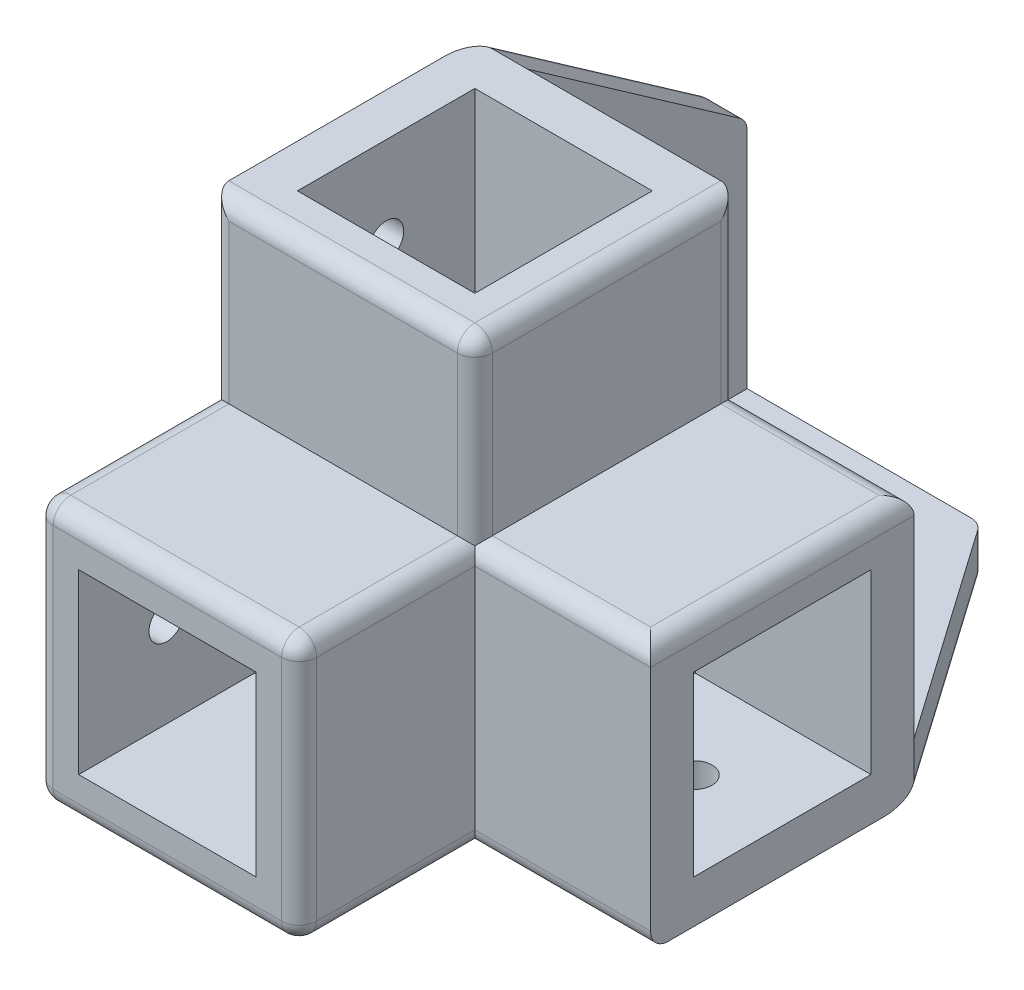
ISO-10303-21;
HEADER;
FILE_DESCRIPTION(('STEP AP214'),'2;1');
FILE_NAME('part.step','',(''),(''),'','','');
FILE_SCHEMA(('AUTOMOTIVE_DESIGN { 1 0 10303 214 1 1 1 1 }'));
ENDSEC;
DATA;
#1=APPLICATION_CONTEXT('core data for automotive mechanical design processes');
#2=APPLICATION_PROTOCOL_DEFINITION('international standard','automotive_design',2000,#1);
#3=PRODUCT_CONTEXT('',#1,'mechanical');
#4=PRODUCT('Part','Part','',(#3));
#5=PRODUCT_RELATED_PRODUCT_CATEGORY('part','',(#4));
#6=PRODUCT_DEFINITION_FORMATION('','',#4);
#7=PRODUCT_DEFINITION_CONTEXT('part definition',#1,'design');
#8=PRODUCT_DEFINITION('design','',#6,#7);
#9=PRODUCT_DEFINITION_SHAPE('','',#8);
#10=(LENGTH_UNIT() NAMED_UNIT(*) SI_UNIT(.MILLI.,.METRE.));
#11=(NAMED_UNIT(*) PLANE_ANGLE_UNIT() SI_UNIT($,.RADIAN.));
#12=(NAMED_UNIT(*) SI_UNIT($,.STERADIAN.) SOLID_ANGLE_UNIT());
#13=UNCERTAINTY_MEASURE_WITH_UNIT(LENGTH_MEASURE(1.E-05),#10,'distance_accuracy_value','');
#14=(GEOMETRIC_REPRESENTATION_CONTEXT(3) GLOBAL_UNCERTAINTY_ASSIGNED_CONTEXT((#13)) GLOBAL_UNIT_ASSIGNED_CONTEXT((#10,
#11,#12)) REPRESENTATION_CONTEXT('',''));
#15=CARTESIAN_POINT('',(0.,0.,0.));
#16=DIRECTION('',(0.,0.,1.));
#17=DIRECTION('',(1.,0.,0.));
#18=AXIS2_PLACEMENT_3D('',#15,#16,#17);
#19=CARTESIAN_POINT('',(0.,0.,30.));
#20=DIRECTION('',(0.,0.,1.));
#21=DIRECTION('',(1.,0.,0.));
#22=AXIS2_PLACEMENT_3D('',#19,#20,#21);
#23=PLANE('',#22);
#24=DIRECTION('',(1.,0.,0.));
#25=VECTOR('',#24,1.);
#26=CARTESIAN_POINT('',(0.,48.,30.));
#27=LINE('',#26,#25);
#28=CARTESIAN_POINT('',(28.,48.,30.));
#29=VERTEX_POINT('',#28);
#30=CARTESIAN_POINT('',(2.,48.,30.));
#31=VERTEX_POINT('',#30);
#32=EDGE_CURVE('E71',#29,#31,#27,.F.);
#33=ORIENTED_EDGE('',*,*,#32,.T.);
#34=DIRECTION('',(0.,-1.,0.));
#35=VECTOR('',#34,1.);
#36=CARTESIAN_POINT('',(2.,30.,30.));
#37=LINE('',#36,#35);
#38=CARTESIAN_POINT('',(2.,30.,30.));
#39=VERTEX_POINT('',#38);
#40=EDGE_CURVE('E845',#31,#39,#37,.T.);
#41=ORIENTED_EDGE('',*,*,#40,.T.);
#42=DIRECTION('',(-1.,0.,0.));
#43=VECTOR('',#42,1.);
#44=CARTESIAN_POINT('',(30.,30.,30.));
#45=LINE('',#44,#43);
#46=CARTESIAN_POINT('',(28.,30.,30.));
#47=VERTEX_POINT('',#46);
#48=EDGE_CURVE('E591',#47,#39,#45,.T.);
#49=ORIENTED_EDGE('',*,*,#48,.F.);
#50=DIRECTION('',(0.,-1.,0.));
#51=VECTOR('',#50,1.);
#52=CARTESIAN_POINT('',(28.,0.,30.));
#53=LINE('',#52,#51);
#54=EDGE_CURVE('E840',#47,#29,#53,.F.);
#55=ORIENTED_EDGE('',*,*,#54,.T.);
#56=EDGE_LOOP('',(#33,#41,#49,#55));
#57=FACE_BOUND('',#56,.T.);
#58=ADVANCED_FACE('F47',(#57),#23,.T.);
#59=CARTESIAN_POINT('',(0.,6.,0.));
#60=DIRECTION('',(0.,-1.,0.));
#61=DIRECTION('',(0.,0.,-1.));
#62=AXIS2_PLACEMENT_3D('',#59,#60,#61);
#63=PLANE('',#62);
#64=DIRECTION('',(0.,0.,-1.));
#65=VECTOR('',#64,1.);
#66=CARTESIAN_POINT('',(6.,6.,-6.00000000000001));
#67=LINE('',#66,#65);
#68=CARTESIAN_POINT('',(6.,6.,-5.99999999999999));
#69=VERTEX_POINT('',#68);
#70=CARTESIAN_POINT('',(6.,6.,-19.));
#71=VERTEX_POINT('',#70);
#72=EDGE_CURVE('E397',#69,#71,#67,.T.);
#73=ORIENTED_EDGE('',*,*,#72,.T.);
#74=DIRECTION('',(-1.,0.,0.));
#75=VECTOR('',#74,1.);
#76=CARTESIAN_POINT('',(6.,6.,-19.));
#77=LINE('',#76,#75);
#78=CARTESIAN_POINT('',(0.,6.,-19.));
#79=VERTEX_POINT('',#78);
#80=EDGE_CURVE('E348',#71,#79,#77,.T.);
#81=ORIENTED_EDGE('',*,*,#80,.T.);
#82=DIRECTION('',(0.,0.,-1.));
#83=VECTOR('',#82,1.);
#84=CARTESIAN_POINT('',(0.,6.,0.));
#85=LINE('',#84,#83);
#86=CARTESIAN_POINT('',(0.,6.,-6.));
#87=VERTEX_POINT('',#86);
#88=EDGE_CURVE('E446',#87,#79,#85,.T.);
#89=ORIENTED_EDGE('',*,*,#88,.F.);
#90=DIRECTION('',(-1.,0.,0.));
#91=VECTOR('',#90,1.);
#92=CARTESIAN_POINT('',(6.,6.,-5.99999999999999));
#93=LINE('',#92,#91);
#94=EDGE_CURVE('E413',#69,#87,#93,.T.);
#95=ORIENTED_EDGE('',*,*,#94,.F.);
#96=EDGE_LOOP('',(#73,#81,#89,#95));
#97=FACE_BOUND('',#96,.T.);
#98=ADVANCED_FACE('F411',(#97),#63,.F.);
#99=CARTESIAN_POINT('',(50.,0.,30.));
#100=DIRECTION('',(0.,-1.,0.));
#101=DIRECTION('',(0.,0.,-1.));
#102=AXIS2_PLACEMENT_3D('',#99,#100,#101);
#103=PLANE('',#102);
#104=CARTESIAN_POINT('',(40.,0.,15.));
#105=DIRECTION('',(0.,-1.,0.));
#106=DIRECTION('',(0.,0.,-1.));
#107=AXIS2_PLACEMENT_3D('',#104,#105,#106);
#108=CIRCLE('',#107,2.);
#109=CARTESIAN_POINT('',(40.,0.,13.));
#110=VERTEX_POINT('',#109);
#111=EDGE_CURVE('E907',#110,#110,#108,.T.);
#112=ORIENTED_EDGE('',*,*,#111,.F.);
#113=EDGE_LOOP('',(#112));
#114=FACE_BOUND('',#113,.T.);
#115=DIRECTION('',(1.,0.,0.));
#116=VECTOR('',#115,1.);
#117=CARTESIAN_POINT('',(50.,0.,-23.));
#118=LINE('',#117,#116);
#119=CARTESIAN_POINT('',(2.,0.,-23.));
#120=VERTEX_POINT('',#119);
#121=CARTESIAN_POINT('',(31.4536774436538,0.,-23.));
#122=VERTEX_POINT('',#121);
#123=EDGE_CURVE('E710',#120,#122,#118,.T.);
#124=ORIENTED_EDGE('',*,*,#123,.T.);
#125=DIRECTION('',(0.573576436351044,0.,0.819152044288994));
#126=VECTOR('',#125,1.);
#127=CARTESIAN_POINT('',(62.4570852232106,0.,21.2774550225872));
#128=LINE('',#127,#126);
#129=CARTESIAN_POINT('',(50.,0.,3.48689359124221));
#130=VERTEX_POINT('',#129);
#131=EDGE_CURVE('E768',#122,#130,#128,.T.);
#132=ORIENTED_EDGE('',*,*,#131,.T.);
#133=DIRECTION('',(0.,0.,-1.));
#134=VECTOR('',#133,1.);
#135=CARTESIAN_POINT('',(50.,0.,30.));
#136=LINE('',#135,#134);
#137=CARTESIAN_POINT('',(50.,0.,28.));
#138=VERTEX_POINT('',#137);
#139=EDGE_CURVE('E608',#138,#130,#136,.T.);
#140=ORIENTED_EDGE('',*,*,#139,.F.);
#141=DIRECTION('',(-1.,0.,0.));
#142=VECTOR('',#141,1.);
#143=CARTESIAN_POINT('',(50.,0.,28.));
#144=LINE('',#143,#142);
#145=CARTESIAN_POINT('',(28.,0.,28.));
#146=VERTEX_POINT('',#145);
#147=EDGE_CURVE('E629',#138,#146,#144,.T.);
#148=ORIENTED_EDGE('',*,*,#147,.T.);
#149=DIRECTION('',(0.,0.,-1.));
#150=VECTOR('',#149,1.);
#151=CARTESIAN_POINT('',(28.,0.,50.));
#152=LINE('',#151,#150);
#153=CARTESIAN_POINT('',(28.,0.,48.));
#154=VERTEX_POINT('',#153);
#155=EDGE_CURVE('E632',#146,#154,#152,.F.);
#156=ORIENTED_EDGE('',*,*,#155,.T.);
#157=DIRECTION('',(1.,0.,0.));
#158=VECTOR('',#157,1.);
#159=CARTESIAN_POINT('',(0.,0.,48.));
#160=LINE('',#159,#158);
#161=CARTESIAN_POINT('',(2.,0.,48.));
#162=VERTEX_POINT('',#161);
#163=EDGE_CURVE('E677',#154,#162,#160,.F.);
#164=ORIENTED_EDGE('',*,*,#163,.T.);
#165=DIRECTION('',(0.,0.,-1.));
#166=VECTOR('',#165,1.);
#167=CARTESIAN_POINT('',(2.,0.,-25.));
#168=LINE('',#167,#166);
#169=EDGE_CURVE('E673',#162,#120,#168,.T.);
#170=ORIENTED_EDGE('',*,*,#169,.T.);
#171=EDGE_LOOP('',(#124,#132,#140,#148,#156,#164,#170));
#172=FACE_BOUND('',#171,.T.);
#173=DIRECTION('',(-1.,0.,0.));
#174=VECTOR('',#173,1.);
#175=CARTESIAN_POINT('',(38.474107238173,0.,-6.));
#176=LINE('',#175,#174);
#177=CARTESIAN_POINT('',(38.474107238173,0.,-6.));
#178=VERTEX_POINT('',#177);
#179=CARTESIAN_POINT('',(6.,0.,-6.00000000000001));
#180=VERTEX_POINT('',#179);
#181=EDGE_CURVE('E424',#178,#180,#176,.T.);
#182=ORIENTED_EDGE('',*,*,#181,.F.);
#183=DIRECTION('',(0.573576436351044,0.,0.819152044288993));
#184=VECTOR('',#183,1.);
#185=CARTESIAN_POINT('',(29.3714092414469,0.,-19.));
#186=LINE('',#185,#184);
#187=CARTESIAN_POINT('',(29.3714092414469,0.,-19.));
#188=VERTEX_POINT('',#187);
#189=EDGE_CURVE('E419',#188,#178,#186,.T.);
#190=ORIENTED_EDGE('',*,*,#189,.F.);
#191=DIRECTION('',(1.,0.,0.));
#192=VECTOR('',#191,1.);
#193=CARTESIAN_POINT('',(6.,0.,-19.));
#194=LINE('',#193,#192);
#195=CARTESIAN_POINT('',(6.,0.,-19.));
#196=VERTEX_POINT('',#195);
#197=EDGE_CURVE('E429',#196,#188,#194,.T.);
#198=ORIENTED_EDGE('',*,*,#197,.F.);
#199=DIRECTION('',(0.,0.,-1.));
#200=VECTOR('',#199,1.);
#201=CARTESIAN_POINT('',(6.,0.,-6.00000000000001));
#202=LINE('',#201,#200);
#203=EDGE_CURVE('E405',#180,#196,#202,.T.);
#204=ORIENTED_EDGE('',*,*,#203,.F.);
#205=EDGE_LOOP('',(#182,#190,#198,#204));
#206=FACE_BOUND('',#205,.T.);
#207=ADVANCED_FACE('F1036',(#114,#172,#206),#103,.T.);
#208=CARTESIAN_POINT('',(50.,0.,30.));
#209=DIRECTION('',(-1.,0.,0.));
#210=DIRECTION('',(0.,0.,1.));
#211=AXIS2_PLACEMENT_3D('',#208,#209,#210);
#212=PLANE('',#211);
#213=DIRECTION('',(0.,0.,1.));
#214=VECTOR('',#213,1.);
#215=CARTESIAN_POINT('',(50.,25.1,25.1));
#216=LINE('',#215,#214);
#217=CARTESIAN_POINT('',(50.,25.1,4.9));
#218=VERTEX_POINT('',#217);
#219=CARTESIAN_POINT('',(50.,25.1,25.1));
#220=VERTEX_POINT('',#219);
#221=EDGE_CURVE('E520',#218,#220,#216,.T.);
#222=ORIENTED_EDGE('',*,*,#221,.F.);
#223=DIRECTION('',(0.,1.,0.));
#224=VECTOR('',#223,1.);
#225=CARTESIAN_POINT('',(50.,25.1,4.9));
#226=LINE('',#225,#224);
#227=CARTESIAN_POINT('',(50.,4.89999999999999,4.9));
#228=VERTEX_POINT('',#227);
#229=EDGE_CURVE('E490',#228,#218,#226,.T.);
#230=ORIENTED_EDGE('',*,*,#229,.F.);
#231=DIRECTION('',(0.,0.,-1.));
#232=VECTOR('',#231,1.);
#233=CARTESIAN_POINT('',(50.,4.89999999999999,25.1));
#234=LINE('',#233,#232);
#235=CARTESIAN_POINT('',(50.,4.89999999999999,25.1));
#236=VERTEX_POINT('',#235);
#237=EDGE_CURVE('E505',#236,#228,#234,.T.);
#238=ORIENTED_EDGE('',*,*,#237,.F.);
#239=DIRECTION('',(0.,-1.,0.));
#240=VECTOR('',#239,1.);
#241=CARTESIAN_POINT('',(50.,25.1,25.1));
#242=LINE('',#241,#240);
#243=EDGE_CURVE('E524',#220,#236,#242,.T.);
#244=ORIENTED_EDGE('',*,*,#243,.F.);
#245=EDGE_LOOP('',(#222,#230,#238,#244));
#246=FACE_BOUND('',#245,.T.);
#247=DIRECTION('',(0.,1.,0.));
#248=VECTOR('',#247,1.);
#249=CARTESIAN_POINT('',(50.,0.,0.));
#250=LINE('',#249,#248);
#251=CARTESIAN_POINT('',(50.,6.,0.));
#252=VERTEX_POINT('',#251);
#253=CARTESIAN_POINT('',(50.,28.,0.));
#254=VERTEX_POINT('',#253);
#255=EDGE_CURVE('E605',#252,#254,#250,.T.);
#256=ORIENTED_EDGE('',*,*,#255,.T.);
#257=DIRECTION('',(0.,0.,-1.));
#258=VECTOR('',#257,1.);
#259=CARTESIAN_POINT('',(50.,28.,30.));
#260=LINE('',#259,#258);
#261=CARTESIAN_POINT('',(50.,28.,30.));
#262=VERTEX_POINT('',#261);
#263=EDGE_CURVE('E848',#254,#262,#260,.F.);
#264=ORIENTED_EDGE('',*,*,#263,.T.);
#265=DIRECTION('',(0.,1.,0.));
#266=VECTOR('',#265,1.);
#267=CARTESIAN_POINT('',(50.,0.,30.));
#268=LINE('',#267,#266);
#269=CARTESIAN_POINT('',(50.,2.,30.));
#270=VERTEX_POINT('',#269);
#271=EDGE_CURVE('E596',#270,#262,#268,.T.);
#272=ORIENTED_EDGE('',*,*,#271,.F.);
#273=CARTESIAN_POINT('',(50.,2.,28.));
#274=DIRECTION('',(-1.,0.,0.));
#275=DIRECTION('',(0.,0.,1.));
#276=AXIS2_PLACEMENT_3D('',#273,#274,#275);
#277=CIRCLE('',#276,2.);
#278=EDGE_CURVE('E639',#270,#138,#277,.F.);
#279=ORIENTED_EDGE('',*,*,#278,.T.);
#280=ORIENTED_EDGE('',*,*,#139,.T.);
#281=CARTESIAN_POINT('',(50.,2.,3.48689359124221));
#282=DIRECTION('',(-1.,0.,0.));
#283=DIRECTION('',(0.,0.,1.));
#284=AXIS2_PLACEMENT_3D('',#281,#282,#283);
#285=ELLIPSE('',#284,3.48689359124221,2.);
#286=CARTESIAN_POINT('',(50.,2.,0.));
#287=VERTEX_POINT('',#286);
#288=EDGE_CURVE('E771',#130,#287,#285,.F.);
#289=ORIENTED_EDGE('',*,*,#288,.T.);
#290=EDGE_CURVE('E601',#287,#252,#250,.T.);
#291=ORIENTED_EDGE('',*,*,#290,.T.);
#292=EDGE_LOOP('',(#256,#264,#272,#279,#280,#289,#291));
#293=FACE_BOUND('',#292,.T.);
#294=ADVANCED_FACE('F1055',(#246,#293),#212,.F.);
#295=CARTESIAN_POINT('',(50.,30.,30.));
#296=DIRECTION('',(0.,-1.,0.));
#297=DIRECTION('',(1.,0.,0.));
#298=AXIS2_PLACEMENT_3D('',#295,#296,#297);
#299=PLANE('',#298);
#300=DIRECTION('',(0.,0.,-1.));
#301=VECTOR('',#300,1.);
#302=CARTESIAN_POINT('',(48.,30.,30.));
#303=LINE('',#302,#301);
#304=CARTESIAN_POINT('',(48.,30.,28.));
#305=VERTEX_POINT('',#304);
#306=CARTESIAN_POINT('',(48.,30.,2.));
#307=VERTEX_POINT('',#306);
#308=EDGE_CURVE('E822',#305,#307,#303,.T.);
#309=ORIENTED_EDGE('',*,*,#308,.T.);
#310=DIRECTION('',(-1.,0.,0.));
#311=VECTOR('',#310,1.);
#312=CARTESIAN_POINT('',(50.,30.,2.));
#313=LINE('',#312,#311);
#314=CARTESIAN_POINT('',(30.,30.,2.));
#315=VERTEX_POINT('',#314);
#316=EDGE_CURVE('E825',#307,#315,#313,.T.);
#317=ORIENTED_EDGE('',*,*,#316,.T.);
#318=DIRECTION('',(0.,0.,-1.));
#319=VECTOR('',#318,1.);
#320=CARTESIAN_POINT('',(30.,30.,30.));
#321=LINE('',#320,#319);
#322=CARTESIAN_POINT('',(30.,30.,28.));
#323=VERTEX_POINT('',#322);
#324=EDGE_CURVE('E613',#323,#315,#321,.T.);
#325=ORIENTED_EDGE('',*,*,#324,.F.);
#326=DIRECTION('',(-1.,0.,0.));
#327=VECTOR('',#326,1.);
#328=CARTESIAN_POINT('',(50.,30.,28.));
#329=LINE('',#328,#327);
#330=EDGE_CURVE('E819',#323,#305,#329,.F.);
#331=ORIENTED_EDGE('',*,*,#330,.T.);
#332=EDGE_LOOP('',(#309,#317,#325,#331));
#333=FACE_BOUND('',#332,.T.);
#334=ADVANCED_FACE('F1013',(#333),#299,.F.);
#335=CARTESIAN_POINT('',(30.,50.,30.));
#336=DIRECTION('',(1.,0.,0.));
#337=DIRECTION('',(0.,1.,0.));
#338=AXIS2_PLACEMENT_3D('',#335,#336,#337);
#339=PLANE('',#338);
#340=ORIENTED_EDGE('',*,*,#324,.T.);
#341=DIRECTION('',(0.,-1.,0.));
#342=VECTOR('',#341,1.);
#343=CARTESIAN_POINT('',(30.,50.,2.));
#344=LINE('',#343,#342);
#345=CARTESIAN_POINT('',(30.,48.,2.));
#346=VERTEX_POINT('',#345);
#347=EDGE_CURVE('E815',#315,#346,#344,.F.);
#348=ORIENTED_EDGE('',*,*,#347,.T.);
#349=DIRECTION('',(0.,0.,-1.));
#350=VECTOR('',#349,1.);
#351=CARTESIAN_POINT('',(30.,48.,30.));
#352=LINE('',#351,#350);
#353=CARTESIAN_POINT('',(30.,48.,28.));
#354=VERTEX_POINT('',#353);
#355=EDGE_CURVE('E812',#346,#354,#352,.F.);
#356=ORIENTED_EDGE('',*,*,#355,.T.);
#357=DIRECTION('',(0.,-1.,0.));
#358=VECTOR('',#357,1.);
#359=CARTESIAN_POINT('',(30.,50.,28.));
#360=LINE('',#359,#358);
#361=EDGE_CURVE('E809',#354,#323,#360,.T.);
#362=ORIENTED_EDGE('',*,*,#361,.T.);
#363=EDGE_LOOP('',(#340,#348,#356,#362));
#364=FACE_BOUND('',#363,.T.);
#365=ADVANCED_FACE('F998',(#364),#339,.T.);
#366=CARTESIAN_POINT('',(0.,50.,30.));
#367=DIRECTION('',(0.,1.,0.));
#368=DIRECTION('',(0.,0.,1.));
#369=AXIS2_PLACEMENT_3D('',#366,#367,#368);
#370=PLANE('',#369);
#371=DIRECTION('',(0.,0.,-1.));
#372=VECTOR('',#371,1.);
#373=CARTESIAN_POINT('',(25.1,50.,4.9));
#374=LINE('',#373,#372);
#375=CARTESIAN_POINT('',(25.1,50.,25.1));
#376=VERTEX_POINT('',#375);
#377=CARTESIAN_POINT('',(25.1,50.,4.9));
#378=VERTEX_POINT('',#377);
#379=EDGE_CURVE('E455',#376,#378,#374,.T.);
#380=ORIENTED_EDGE('',*,*,#379,.F.);
#381=DIRECTION('',(1.,0.,0.));
#382=VECTOR('',#381,1.);
#383=CARTESIAN_POINT('',(4.9,50.,25.1));
#384=LINE('',#383,#382);
#385=CARTESIAN_POINT('',(4.9,50.,25.1));
#386=VERTEX_POINT('',#385);
#387=EDGE_CURVE('E461',#386,#376,#384,.T.);
#388=ORIENTED_EDGE('',*,*,#387,.F.);
#389=DIRECTION('',(0.,0.,1.));
#390=VECTOR('',#389,1.);
#391=CARTESIAN_POINT('',(4.89999999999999,50.,4.9));
#392=LINE('',#391,#390);
#393=CARTESIAN_POINT('',(4.89999999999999,50.,4.9));
#394=VERTEX_POINT('',#393);
#395=EDGE_CURVE('E480',#394,#386,#392,.T.);
#396=ORIENTED_EDGE('',*,*,#395,.F.);
#397=DIRECTION('',(-1.,0.,0.));
#398=VECTOR('',#397,1.);
#399=CARTESIAN_POINT('',(4.89999999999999,50.,4.9));
#400=LINE('',#399,#398);
#401=EDGE_CURVE('E476',#378,#394,#400,.T.);
#402=ORIENTED_EDGE('',*,*,#401,.F.);
#403=EDGE_LOOP('',(#380,#388,#396,#402));
#404=FACE_BOUND('',#403,.T.);
#405=DIRECTION('',(1.,0.,0.));
#406=VECTOR('',#405,1.);
#407=CARTESIAN_POINT('',(0.,50.,28.));
#408=LINE('',#407,#406);
#409=CARTESIAN_POINT('',(0.,50.,28.));
#410=VERTEX_POINT('',#409);
#411=CARTESIAN_POINT('',(28.,50.,28.));
#412=VERTEX_POINT('',#411);
#413=EDGE_CURVE('E828',#410,#412,#408,.T.);
#414=ORIENTED_EDGE('',*,*,#413,.T.);
#415=DIRECTION('',(0.,0.,-1.));
#416=VECTOR('',#415,1.);
#417=CARTESIAN_POINT('',(28.,50.,30.));
#418=LINE('',#417,#416);
#419=CARTESIAN_POINT('',(28.,50.,0.));
#420=VERTEX_POINT('',#419);
#421=EDGE_CURVE('E831',#412,#420,#418,.T.);
#422=ORIENTED_EDGE('',*,*,#421,.T.);
#423=DIRECTION('',(1.,0.,0.));
#424=VECTOR('',#423,1.);
#425=CARTESIAN_POINT('',(0.,50.,0.));
#426=LINE('',#425,#424);
#427=CARTESIAN_POINT('',(6.,50.,0.));
#428=VERTEX_POINT('',#427);
#429=EDGE_CURVE('E595',#428,#420,#426,.T.);
#430=ORIENTED_EDGE('',*,*,#429,.F.);
#431=CARTESIAN_POINT('',(2.,50.,0.));
#432=VERTEX_POINT('',#431);
#433=EDGE_CURVE('E602',#432,#428,#426,.T.);
#434=ORIENTED_EDGE('',*,*,#433,.F.);
#435=CARTESIAN_POINT('',(2.,50.,3.4868935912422));
#436=DIRECTION('',(0.,1.,0.));
#437=DIRECTION('',(0.,0.,1.));
#438=AXIS2_PLACEMENT_3D('',#435,#436,#437);
#439=ELLIPSE('',#438,3.48689359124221,2.);
#440=CARTESIAN_POINT('',(0.,50.,3.48689359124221));
#441=VERTEX_POINT('',#440);
#442=EDGE_CURVE('E741',#432,#441,#439,.T.);
#443=ORIENTED_EDGE('',*,*,#442,.T.);
#444=DIRECTION('',(0.,0.,-1.));
#445=VECTOR('',#444,1.);
#446=CARTESIAN_POINT('',(0.,50.,30.));
#447=LINE('',#446,#445);
#448=EDGE_CURVE('E600',#410,#441,#447,.T.);
#449=ORIENTED_EDGE('',*,*,#448,.F.);
#450=EDGE_LOOP('',(#414,#422,#430,#434,#443,#449));
#451=FACE_BOUND('',#450,.T.);
#452=ADVANCED_FACE('F1048',(#404,#451),#370,.T.);
#453=CARTESIAN_POINT('',(0.,50.,30.));
#454=DIRECTION('',(1.,0.,0.));
#455=DIRECTION('',(0.,1.,0.));
#456=AXIS2_PLACEMENT_3D('',#453,#454,#455);
#457=PLANE('',#456);
#458=CARTESIAN_POINT('',(0.,15.,40.));
#459=DIRECTION('',(-1.,0.,0.));
#460=DIRECTION('',(0.,-1.,0.));
#461=AXIS2_PLACEMENT_3D('',#458,#459,#460);
#462=CIRCLE('',#461,2.);
#463=CARTESIAN_POINT('',(0.,13.,40.));
#464=VERTEX_POINT('',#463);
#465=EDGE_CURVE('E924',#464,#464,#462,.T.);
#466=ORIENTED_EDGE('',*,*,#465,.F.);
#467=EDGE_LOOP('',(#466));
#468=FACE_BOUND('',#467,.T.);
#469=CARTESIAN_POINT('',(0.,40.,15.));
#470=DIRECTION('',(-1.,0.,0.));
#471=DIRECTION('',(0.,-1.,0.));
#472=AXIS2_PLACEMENT_3D('',#469,#470,#471);
#473=CIRCLE('',#472,2.);
#474=CARTESIAN_POINT('',(0.,38.,15.));
#475=VERTEX_POINT('',#474);
#476=EDGE_CURVE('E911',#475,#475,#473,.T.);
#477=ORIENTED_EDGE('',*,*,#476,.F.);
#478=EDGE_LOOP('',(#477));
#479=FACE_BOUND('',#478,.T.);
#480=ORIENTED_EDGE('',*,*,#88,.T.);
#481=DIRECTION('',(0.,1.,0.));
#482=VECTOR('',#481,1.);
#483=CARTESIAN_POINT('',(0.,6.,-19.));
#484=LINE('',#483,#482);
#485=CARTESIAN_POINT('',(0.,29.3714092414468,-19.));
#486=VERTEX_POINT('',#485);
#487=EDGE_CURVE('E353',#79,#486,#484,.T.);
#488=ORIENTED_EDGE('',*,*,#487,.T.);
#489=DIRECTION('',(0.,0.573576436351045,0.819152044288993));
#490=VECTOR('',#489,1.);
#491=CARTESIAN_POINT('',(0.,29.3714092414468,-19.));
#492=LINE('',#491,#490);
#493=CARTESIAN_POINT('',(0.,38.474107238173,-6.));
#494=VERTEX_POINT('',#493);
#495=EDGE_CURVE('E949',#486,#494,#492,.T.);
#496=ORIENTED_EDGE('',*,*,#495,.T.);
#497=DIRECTION('',(0.,-1.,0.));
#498=VECTOR('',#497,1.);
#499=CARTESIAN_POINT('',(0.,38.474107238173,-6.));
#500=LINE('',#499,#498);
#501=EDGE_CURVE('E385',#494,#87,#500,.T.);
#502=ORIENTED_EDGE('',*,*,#501,.T.);
#503=EDGE_LOOP('',(#480,#488,#496,#502));
#504=FACE_BOUND('',#503,.T.);
#505=DIRECTION('',(0.,0.,-1.));
#506=VECTOR('',#505,1.);
#507=CARTESIAN_POINT('',(0.,2.,50.));
#508=LINE('',#507,#506);
#509=CARTESIAN_POINT('',(0.,2.,-23.));
#510=VERTEX_POINT('',#509);
#511=CARTESIAN_POINT('',(0.,2.,48.));
#512=VERTEX_POINT('',#511);
#513=EDGE_CURVE('E657',#510,#512,#508,.F.);
#514=ORIENTED_EDGE('',*,*,#513,.T.);
#515=DIRECTION('',(0.,-1.,0.));
#516=VECTOR('',#515,1.);
#517=CARTESIAN_POINT('',(0.,50.,48.));
#518=LINE('',#517,#516);
#519=CARTESIAN_POINT('',(0.,28.,48.));
#520=VERTEX_POINT('',#519);
#521=EDGE_CURVE('E797',#512,#520,#518,.F.);
#522=ORIENTED_EDGE('',*,*,#521,.T.);
#523=DIRECTION('',(0.,0.,-1.));
#524=VECTOR('',#523,1.);
#525=CARTESIAN_POINT('',(0.,28.,30.));
#526=LINE('',#525,#524);
#527=CARTESIAN_POINT('',(0.,28.,28.));
#528=VERTEX_POINT('',#527);
#529=EDGE_CURVE('E794',#520,#528,#526,.T.);
#530=ORIENTED_EDGE('',*,*,#529,.T.);
#531=DIRECTION('',(0.,-1.,0.));
#532=VECTOR('',#531,1.);
#533=CARTESIAN_POINT('',(0.,50.,28.));
#534=LINE('',#533,#532);
#535=EDGE_CURVE('E791',#528,#410,#534,.F.);
#536=ORIENTED_EDGE('',*,*,#535,.T.);
#537=ORIENTED_EDGE('',*,*,#448,.T.);
#538=DIRECTION('',(0.,-0.573576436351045,-0.819152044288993));
#539=VECTOR('',#538,1.);
#540=CARTESIAN_POINT('',(0.,32.2569225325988,-21.8528471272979));
#541=LINE('',#540,#539);
#542=CARTESIAN_POINT('',(0.,31.4536774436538,-23.));
#543=VERTEX_POINT('',#542);
#544=EDGE_CURVE('E738',#441,#543,#541,.T.);
#545=ORIENTED_EDGE('',*,*,#544,.T.);
#546=DIRECTION('',(0.,-1.,0.));
#547=VECTOR('',#546,1.);
#548=CARTESIAN_POINT('',(0.,2.,-23.));
#549=LINE('',#548,#547);
#550=EDGE_CURVE('E681',#543,#510,#549,.T.);
#551=ORIENTED_EDGE('',*,*,#550,.T.);
#552=EDGE_LOOP('',(#514,#522,#530,#536,#537,#545,#551));
#553=FACE_BOUND('',#552,.T.);
#554=ADVANCED_FACE('F966',(#468,#479,#504,#553),#457,.F.);
#555=ORIENTED_EDGE('',*,*,#271,.T.);
#556=DIRECTION('',(-1.,0.,0.));
#557=VECTOR('',#556,1.);
#558=CARTESIAN_POINT('',(30.,28.,30.));
#559=LINE('',#558,#557);
#560=CARTESIAN_POINT('',(30.,28.,30.));
#561=VERTEX_POINT('',#560);
#562=EDGE_CURVE('E837',#262,#561,#559,.T.);
#563=ORIENTED_EDGE('',*,*,#562,.T.);
#564=DIRECTION('',(0.,1.,0.));
#565=VECTOR('',#564,1.);
#566=CARTESIAN_POINT('',(30.,30.,30.));
#567=LINE('',#566,#565);
#568=CARTESIAN_POINT('',(30.,2.00000000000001,30.));
#569=VERTEX_POINT('',#568);
#570=EDGE_CURVE('E578',#569,#561,#567,.T.);
#571=ORIENTED_EDGE('',*,*,#570,.F.);
#572=DIRECTION('',(-1.,0.,0.));
#573=VECTOR('',#572,1.);
#574=CARTESIAN_POINT('',(0.,2.,30.));
#575=LINE('',#574,#573);
#576=EDGE_CURVE('E636',#569,#270,#575,.F.);
#577=ORIENTED_EDGE('',*,*,#576,.T.);
#578=EDGE_LOOP('',(#555,#563,#571,#577));
#579=FACE_BOUND('',#578,.T.);
#580=ADVANCED_FACE('F1031',(#579),#23,.T.);
#581=CARTESIAN_POINT('',(0.,0.,0.));
#582=DIRECTION('',(0.,0.,1.));
#583=DIRECTION('',(1.,0.,0.));
#584=AXIS2_PLACEMENT_3D('',#581,#582,#583);
#585=PLANE('',#584);
#586=ORIENTED_EDGE('',*,*,#429,.T.);
#587=DIRECTION('',(0.,-1.,0.));
#588=VECTOR('',#587,1.);
#589=CARTESIAN_POINT('',(28.,30.,0.));
#590=LINE('',#589,#588);
#591=CARTESIAN_POINT('',(28.,28.,0.));
#592=VERTEX_POINT('',#591);
#593=EDGE_CURVE('E806',#420,#592,#590,.T.);
#594=ORIENTED_EDGE('',*,*,#593,.T.);
#595=DIRECTION('',(-1.,0.,0.));
#596=VECTOR('',#595,1.);
#597=CARTESIAN_POINT('',(0.,28.,0.));
#598=LINE('',#597,#596);
#599=EDGE_CURVE('E803',#592,#254,#598,.F.);
#600=ORIENTED_EDGE('',*,*,#599,.T.);
#601=ORIENTED_EDGE('',*,*,#255,.F.);
#602=DIRECTION('',(-1.,0.,0.));
#603=VECTOR('',#602,1.);
#604=CARTESIAN_POINT('',(50.,6.,0.));
#605=LINE('',#604,#603);
#606=CARTESIAN_POINT('',(6.,6.,0.));
#607=VERTEX_POINT('',#606);
#608=EDGE_CURVE('E438',#252,#607,#605,.T.);
#609=ORIENTED_EDGE('',*,*,#608,.T.);
#610=DIRECTION('',(0.,1.,0.));
#611=VECTOR('',#610,1.);
#612=CARTESIAN_POINT('',(6.,50.,0.));
#613=LINE('',#612,#611);
#614=EDGE_CURVE('E937',#607,#428,#613,.T.);
#615=ORIENTED_EDGE('',*,*,#614,.T.);
#616=EDGE_LOOP('',(#586,#594,#600,#601,#609,#615));
#617=FACE_BOUND('',#616,.T.);
#618=ADVANCED_FACE('F976',(#617),#585,.F.);
#619=CARTESIAN_POINT('',(30.,30.,50.));
#620=DIRECTION('',(-1.,0.,0.));
#621=DIRECTION('',(0.,-1.,0.));
#622=AXIS2_PLACEMENT_3D('',#619,#620,#621);
#623=PLANE('',#622);
#624=DIRECTION('',(0.,0.,-1.));
#625=VECTOR('',#624,1.);
#626=CARTESIAN_POINT('',(30.,28.,50.));
#627=LINE('',#626,#625);
#628=CARTESIAN_POINT('',(30.,28.,48.));
#629=VERTEX_POINT('',#628);
#630=EDGE_CURVE('E625',#561,#629,#627,.F.);
#631=ORIENTED_EDGE('',*,*,#630,.T.);
#632=DIRECTION('',(0.,1.,0.));
#633=VECTOR('',#632,1.);
#634=CARTESIAN_POINT('',(30.,30.,48.));
#635=LINE('',#634,#633);
#636=CARTESIAN_POINT('',(30.,2.,48.));
#637=VERTEX_POINT('',#636);
#638=EDGE_CURVE('E667',#629,#637,#635,.F.);
#639=ORIENTED_EDGE('',*,*,#638,.T.);
#640=DIRECTION('',(0.,0.,-1.));
#641=VECTOR('',#640,1.);
#642=CARTESIAN_POINT('',(30.,2.,30.));
#643=LINE('',#642,#641);
#644=EDGE_CURVE('E622',#637,#569,#643,.T.);
#645=ORIENTED_EDGE('',*,*,#644,.T.);
#646=ORIENTED_EDGE('',*,*,#570,.T.);
#647=EDGE_LOOP('',(#631,#639,#645,#646));
#648=FACE_BOUND('',#647,.T.);
#649=ADVANCED_FACE('F1046',(#648),#623,.F.);
#650=CARTESIAN_POINT('',(30.,30.,50.));
#651=DIRECTION('',(0.,-1.,0.));
#652=DIRECTION('',(1.,0.,0.));
#653=AXIS2_PLACEMENT_3D('',#650,#651,#652);
#654=PLANE('',#653);
#655=ORIENTED_EDGE('',*,*,#48,.T.);
#656=DIRECTION('',(0.,0.,-1.));
#657=VECTOR('',#656,1.);
#658=CARTESIAN_POINT('',(2.,30.,50.));
#659=LINE('',#658,#657);
#660=CARTESIAN_POINT('',(2.,30.,48.));
#661=VERTEX_POINT('',#660);
#662=EDGE_CURVE('E834',#39,#661,#659,.F.);
#663=ORIENTED_EDGE('',*,*,#662,.T.);
#664=DIRECTION('',(-1.,0.,0.));
#665=VECTOR('',#664,1.);
#666=CARTESIAN_POINT('',(30.,30.,48.));
#667=LINE('',#666,#665);
#668=CARTESIAN_POINT('',(28.,30.,48.));
#669=VERTEX_POINT('',#668);
#670=EDGE_CURVE('E661',#661,#669,#667,.F.);
#671=ORIENTED_EDGE('',*,*,#670,.T.);
#672=DIRECTION('',(0.,0.,-1.));
#673=VECTOR('',#672,1.);
#674=CARTESIAN_POINT('',(28.,30.,50.));
#675=LINE('',#674,#673);
#676=EDGE_CURVE('E612',#669,#47,#675,.T.);
#677=ORIENTED_EDGE('',*,*,#676,.T.);
#678=EDGE_LOOP('',(#655,#663,#671,#677));
#679=FACE_BOUND('',#678,.T.);
#680=ADVANCED_FACE('F1210',(#679),#654,.F.);
#681=CARTESIAN_POINT('',(0.,0.,50.));
#682=DIRECTION('',(0.,0.,-1.));
#683=DIRECTION('',(-1.,0.,0.));
#684=AXIS2_PLACEMENT_3D('',#681,#682,#683);
#685=PLANE('',#684);
#686=DIRECTION('',(-1.,0.,0.));
#687=VECTOR('',#686,1.);
#688=CARTESIAN_POINT('',(4.9,25.1,50.));
#689=LINE('',#688,#687);
#690=CARTESIAN_POINT('',(25.1,25.1,50.));
#691=VERTEX_POINT('',#690);
#692=CARTESIAN_POINT('',(4.9,25.1,50.));
#693=VERTEX_POINT('',#692);
#694=EDGE_CURVE('E564',#691,#693,#689,.T.);
#695=ORIENTED_EDGE('',*,*,#694,.F.);
#696=DIRECTION('',(0.,1.,0.));
#697=VECTOR('',#696,1.);
#698=CARTESIAN_POINT('',(25.1,25.1,50.));
#699=LINE('',#698,#697);
#700=CARTESIAN_POINT('',(25.1,4.9,50.));
#701=VERTEX_POINT('',#700);
#702=EDGE_CURVE('E534',#701,#691,#699,.T.);
#703=ORIENTED_EDGE('',*,*,#702,.F.);
#704=DIRECTION('',(1.,0.,0.));
#705=VECTOR('',#704,1.);
#706=CARTESIAN_POINT('',(4.9,4.9,50.));
#707=LINE('',#706,#705);
#708=CARTESIAN_POINT('',(4.9,4.9,50.));
#709=VERTEX_POINT('',#708);
#710=EDGE_CURVE('E549',#709,#701,#707,.T.);
#711=ORIENTED_EDGE('',*,*,#710,.F.);
#712=DIRECTION('',(0.,-1.,0.));
#713=VECTOR('',#712,1.);
#714=CARTESIAN_POINT('',(4.9,25.1,50.));
#715=LINE('',#714,#713);
#716=EDGE_CURVE('E568',#693,#709,#715,.T.);
#717=ORIENTED_EDGE('',*,*,#716,.F.);
#718=EDGE_LOOP('',(#695,#703,#711,#717));
#719=FACE_BOUND('',#718,.T.);
#720=DIRECTION('',(-1.,0.,0.));
#721=VECTOR('',#720,1.);
#722=CARTESIAN_POINT('',(0.,28.,50.));
#723=LINE('',#722,#721);
#724=CARTESIAN_POINT('',(28.,28.,50.));
#725=VERTEX_POINT('',#724);
#726=CARTESIAN_POINT('',(2.,28.,50.));
#727=VERTEX_POINT('',#726);
#728=EDGE_CURVE('E653',#725,#727,#723,.T.);
#729=ORIENTED_EDGE('',*,*,#728,.T.);
#730=DIRECTION('',(0.,-1.,0.));
#731=VECTOR('',#730,1.);
#732=CARTESIAN_POINT('',(2.,0.,50.));
#733=LINE('',#732,#731);
#734=CARTESIAN_POINT('',(2.,2.,50.));
#735=VERTEX_POINT('',#734);
#736=EDGE_CURVE('E788',#727,#735,#733,.T.);
#737=ORIENTED_EDGE('',*,*,#736,.T.);
#738=DIRECTION('',(1.,0.,0.));
#739=VECTOR('',#738,1.);
#740=CARTESIAN_POINT('',(28.,2.,50.));
#741=LINE('',#740,#739);
#742=CARTESIAN_POINT('',(28.,2.,50.));
#743=VERTEX_POINT('',#742);
#744=EDGE_CURVE('E642',#735,#743,#741,.T.);
#745=ORIENTED_EDGE('',*,*,#744,.T.);
#746=DIRECTION('',(0.,1.,0.));
#747=VECTOR('',#746,1.);
#748=CARTESIAN_POINT('',(28.,0.,50.));
#749=LINE('',#748,#747);
#750=EDGE_CURVE('E650',#743,#725,#749,.T.);
#751=ORIENTED_EDGE('',*,*,#750,.T.);
#752=EDGE_LOOP('',(#729,#737,#745,#751));
#753=FACE_BOUND('',#752,.T.);
#754=ADVANCED_FACE('F1080',(#719,#753),#685,.F.);
#755=CARTESIAN_POINT('',(25.1,25.1,30.));
#756=DIRECTION('',(1.,0.,0.));
#757=DIRECTION('',(0.,0.,-1.));
#758=AXIS2_PLACEMENT_3D('',#755,#756,#757);
#759=PLANE('',#758);
#760=ORIENTED_EDGE('',*,*,#702,.T.);
#761=DIRECTION('',(0.,0.,1.));
#762=VECTOR('',#761,1.);
#763=CARTESIAN_POINT('',(25.1,25.1,30.));
#764=LINE('',#763,#762);
#765=CARTESIAN_POINT('',(25.1,25.1,30.));
#766=VERTEX_POINT('',#765);
#767=EDGE_CURVE('E561',#766,#691,#764,.T.);
#768=ORIENTED_EDGE('',*,*,#767,.F.);
#769=DIRECTION('',(0.,1.,0.));
#770=VECTOR('',#769,1.);
#771=CARTESIAN_POINT('',(25.1,25.1,30.));
#772=LINE('',#771,#770);
#773=CARTESIAN_POINT('',(25.1,4.9,30.));
#774=VERTEX_POINT('',#773);
#775=EDGE_CURVE('E544',#774,#766,#772,.T.);
#776=ORIENTED_EDGE('',*,*,#775,.F.);
#777=DIRECTION('',(0.,0.,1.));
#778=VECTOR('',#777,1.);
#779=CARTESIAN_POINT('',(25.1,4.9,30.));
#780=LINE('',#779,#778);
#781=EDGE_CURVE('E575',#774,#701,#780,.T.);
#782=ORIENTED_EDGE('',*,*,#781,.T.);
#783=EDGE_LOOP('',(#760,#768,#776,#782));
#784=FACE_BOUND('',#783,.T.);
#785=ADVANCED_FACE('F1197',(#784),#759,.F.);
#786=CARTESIAN_POINT('',(4.9,4.9,30.));
#787=DIRECTION('',(0.,-1.,0.));
#788=DIRECTION('',(0.,0.,-1.));
#789=AXIS2_PLACEMENT_3D('',#786,#787,#788);
#790=PLANE('',#789);
#791=ORIENTED_EDGE('',*,*,#710,.T.);
#792=ORIENTED_EDGE('',*,*,#781,.F.);
#793=DIRECTION('',(1.,0.,0.));
#794=VECTOR('',#793,1.);
#795=CARTESIAN_POINT('',(4.9,4.9,30.));
#796=LINE('',#795,#794);
#797=CARTESIAN_POINT('',(4.9,4.9,30.));
#798=VERTEX_POINT('',#797);
#799=EDGE_CURVE('E557',#798,#774,#796,.T.);
#800=ORIENTED_EDGE('',*,*,#799,.F.);
#801=DIRECTION('',(0.,0.,1.));
#802=VECTOR('',#801,1.);
#803=CARTESIAN_POINT('',(4.9,4.9,30.));
#804=LINE('',#803,#802);
#805=EDGE_CURVE('E579',#798,#709,#804,.T.);
#806=ORIENTED_EDGE('',*,*,#805,.T.);
#807=EDGE_LOOP('',(#791,#792,#800,#806));
#808=FACE_BOUND('',#807,.T.);
#809=ADVANCED_FACE('F1193',(#808),#790,.F.);
#810=CARTESIAN_POINT('',(4.9,25.1,30.));
#811=DIRECTION('',(-1.,0.,0.));
#812=DIRECTION('',(0.,-1.,0.));
#813=AXIS2_PLACEMENT_3D('',#810,#811,#812);
#814=PLANE('',#813);
#815=CARTESIAN_POINT('',(4.9,15.,40.));
#816=DIRECTION('',(-1.,0.,0.));
#817=DIRECTION('',(0.,-1.,0.));
#818=AXIS2_PLACEMENT_3D('',#815,#816,#817);
#819=CIRCLE('',#818,2.);
#820=CARTESIAN_POINT('',(4.9,13.,40.));
#821=VERTEX_POINT('',#820);
#822=EDGE_CURVE('E51',#821,#821,#819,.T.);
#823=ORIENTED_EDGE('',*,*,#822,.T.);
#824=EDGE_LOOP('',(#823));
#825=FACE_BOUND('',#824,.T.);
#826=ORIENTED_EDGE('',*,*,#716,.T.);
#827=ORIENTED_EDGE('',*,*,#805,.F.);
#828=DIRECTION('',(0.,-1.,0.));
#829=VECTOR('',#828,1.);
#830=CARTESIAN_POINT('',(4.9,25.1,30.));
#831=LINE('',#830,#829);
#832=CARTESIAN_POINT('',(4.9,25.1,30.));
#833=VERTEX_POINT('',#832);
#834=EDGE_CURVE('E553',#833,#798,#831,.T.);
#835=ORIENTED_EDGE('',*,*,#834,.F.);
#836=DIRECTION('',(0.,0.,1.));
#837=VECTOR('',#836,1.);
#838=CARTESIAN_POINT('',(4.9,25.1,30.));
#839=LINE('',#838,#837);
#840=EDGE_CURVE('E582',#833,#693,#839,.T.);
#841=ORIENTED_EDGE('',*,*,#840,.T.);
#842=EDGE_LOOP('',(#826,#827,#835,#841));
#843=FACE_BOUND('',#842,.T.);
#844=ADVANCED_FACE('F1196',(#825,#843),#814,.F.);
#845=CARTESIAN_POINT('',(4.9,25.1,30.));
#846=DIRECTION('',(0.,1.,0.));
#847=DIRECTION('',(0.,0.,1.));
#848=AXIS2_PLACEMENT_3D('',#845,#846,#847);
#849=PLANE('',#848);
#850=ORIENTED_EDGE('',*,*,#694,.T.);
#851=ORIENTED_EDGE('',*,*,#840,.F.);
#852=DIRECTION('',(-1.,0.,0.));
#853=VECTOR('',#852,1.);
#854=CARTESIAN_POINT('',(4.9,25.1,30.));
#855=LINE('',#854,#853);
#856=EDGE_CURVE('E548',#766,#833,#855,.T.);
#857=ORIENTED_EDGE('',*,*,#856,.F.);
#858=ORIENTED_EDGE('',*,*,#767,.T.);
#859=EDGE_LOOP('',(#850,#851,#857,#858));
#860=FACE_BOUND('',#859,.T.);
#861=ADVANCED_FACE('F1191',(#860),#849,.F.);
#862=CARTESIAN_POINT('',(0.,0.,30.));
#863=DIRECTION('',(0.,0.,1.));
#864=DIRECTION('',(1.,0.,0.));
#865=AXIS2_PLACEMENT_3D('',#862,#863,#864);
#866=PLANE('',#865);
#867=ORIENTED_EDGE('',*,*,#775,.T.);
#868=ORIENTED_EDGE('',*,*,#856,.T.);
#869=ORIENTED_EDGE('',*,*,#834,.T.);
#870=ORIENTED_EDGE('',*,*,#799,.T.);
#871=EDGE_LOOP('',(#867,#868,#869,#870));
#872=FACE_BOUND('',#871,.T.);
#873=ADVANCED_FACE('F1187',(#872),#866,.T.);
#874=CARTESIAN_POINT('',(30.,25.1,4.9));
#875=DIRECTION('',(0.,0.,-1.));
#876=DIRECTION('',(0.,1.,0.));
#877=AXIS2_PLACEMENT_3D('',#874,#875,#876);
#878=PLANE('',#877);
#879=ORIENTED_EDGE('',*,*,#229,.T.);
#880=DIRECTION('',(1.,0.,0.));
#881=VECTOR('',#880,1.);
#882=CARTESIAN_POINT('',(30.,25.1,4.9));
#883=LINE('',#882,#881);
#884=CARTESIAN_POINT('',(30.,25.1,4.9));
#885=VERTEX_POINT('',#884);
#886=EDGE_CURVE('E517',#885,#218,#883,.T.);
#887=ORIENTED_EDGE('',*,*,#886,.F.);
#888=DIRECTION('',(0.,1.,0.));
#889=VECTOR('',#888,1.);
#890=CARTESIAN_POINT('',(30.,25.1,4.9));
#891=LINE('',#890,#889);
#892=CARTESIAN_POINT('',(30.,4.89999999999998,4.9));
#893=VERTEX_POINT('',#892);
#894=EDGE_CURVE('E500',#893,#885,#891,.T.);
#895=ORIENTED_EDGE('',*,*,#894,.F.);
#896=DIRECTION('',(1.,0.,0.));
#897=VECTOR('',#896,1.);
#898=CARTESIAN_POINT('',(30.,4.89999999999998,4.9));
#899=LINE('',#898,#897);
#900=EDGE_CURVE('E531',#893,#228,#899,.T.);
#901=ORIENTED_EDGE('',*,*,#900,.T.);
#902=EDGE_LOOP('',(#879,#887,#895,#901));
#903=FACE_BOUND('',#902,.T.);
#904=ADVANCED_FACE('F1177',(#903),#878,.F.);
#905=CARTESIAN_POINT('',(30.,4.89999999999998,25.1));
#906=DIRECTION('',(0.,-1.,0.));
#907=DIRECTION('',(1.,0.,0.));
#908=AXIS2_PLACEMENT_3D('',#905,#906,#907);
#909=PLANE('',#908);
#910=CARTESIAN_POINT('',(40.,4.89999999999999,15.));
#911=DIRECTION('',(0.,-1.,0.));
#912=DIRECTION('',(1.,0.,0.));
#913=AXIS2_PLACEMENT_3D('',#910,#911,#912);
#914=CIRCLE('',#913,2.);
#915=CARTESIAN_POINT('',(42.,4.89999999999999,15.));
#916=VERTEX_POINT('',#915);
#917=EDGE_CURVE('E858',#916,#916,#914,.T.);
#918=ORIENTED_EDGE('',*,*,#917,.T.);
#919=EDGE_LOOP('',(#918));
#920=FACE_BOUND('',#919,.T.);
#921=ORIENTED_EDGE('',*,*,#237,.T.);
#922=ORIENTED_EDGE('',*,*,#900,.F.);
#923=DIRECTION('',(0.,0.,-1.));
#924=VECTOR('',#923,1.);
#925=CARTESIAN_POINT('',(30.,4.89999999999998,25.1));
#926=LINE('',#925,#924);
#927=CARTESIAN_POINT('',(30.,4.89999999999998,25.1));
#928=VERTEX_POINT('',#927);
#929=EDGE_CURVE('E513',#928,#893,#926,.T.);
#930=ORIENTED_EDGE('',*,*,#929,.F.);
#931=DIRECTION('',(1.,0.,0.));
#932=VECTOR('',#931,1.);
#933=CARTESIAN_POINT('',(30.,4.89999999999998,25.1));
#934=LINE('',#933,#932);
#935=EDGE_CURVE('E535',#928,#236,#934,.T.);
#936=ORIENTED_EDGE('',*,*,#935,.T.);
#937=EDGE_LOOP('',(#921,#922,#930,#936));
#938=FACE_BOUND('',#937,.T.);
#939=ADVANCED_FACE('F1173',(#920,#938),#909,.F.);
#940=CARTESIAN_POINT('',(30.,25.1,25.1));
#941=DIRECTION('',(0.,0.,1.));
#942=DIRECTION('',(0.,-1.,0.));
#943=AXIS2_PLACEMENT_3D('',#940,#941,#942);
#944=PLANE('',#943);
#945=ORIENTED_EDGE('',*,*,#243,.T.);
#946=ORIENTED_EDGE('',*,*,#935,.F.);
#947=DIRECTION('',(0.,-1.,0.));
#948=VECTOR('',#947,1.);
#949=CARTESIAN_POINT('',(30.,25.1,25.1));
#950=LINE('',#949,#948);
#951=CARTESIAN_POINT('',(30.,25.1,25.1));
#952=VERTEX_POINT('',#951);
#953=EDGE_CURVE('E509',#952,#928,#950,.T.);
#954=ORIENTED_EDGE('',*,*,#953,.F.);
#955=DIRECTION('',(1.,0.,0.));
#956=VECTOR('',#955,1.);
#957=CARTESIAN_POINT('',(30.,25.1,25.1));
#958=LINE('',#957,#956);
#959=EDGE_CURVE('E538',#952,#220,#958,.T.);
#960=ORIENTED_EDGE('',*,*,#959,.T.);
#961=EDGE_LOOP('',(#945,#946,#954,#960));
#962=FACE_BOUND('',#961,.T.);
#963=ADVANCED_FACE('F1176',(#962),#944,.F.);
#964=CARTESIAN_POINT('',(30.,25.1,25.1));
#965=DIRECTION('',(0.,1.,0.));
#966=DIRECTION('',(-1.,0.,0.));
#967=AXIS2_PLACEMENT_3D('',#964,#965,#966);
#968=PLANE('',#967);
#969=ORIENTED_EDGE('',*,*,#221,.T.);
#970=ORIENTED_EDGE('',*,*,#959,.F.);
#971=DIRECTION('',(0.,0.,1.));
#972=VECTOR('',#971,1.);
#973=CARTESIAN_POINT('',(30.,25.1,25.1));
#974=LINE('',#973,#972);
#975=EDGE_CURVE('E504',#885,#952,#974,.T.);
#976=ORIENTED_EDGE('',*,*,#975,.F.);
#977=ORIENTED_EDGE('',*,*,#886,.T.);
#978=EDGE_LOOP('',(#969,#970,#976,#977));
#979=FACE_BOUND('',#978,.T.);
#980=ADVANCED_FACE('F1171',(#979),#968,.F.);
#981=CARTESIAN_POINT('',(30.,0.,0.));
#982=DIRECTION('',(1.,0.,0.));
#983=DIRECTION('',(0.,1.,0.));
#984=AXIS2_PLACEMENT_3D('',#981,#982,#983);
#985=PLANE('',#984);
#986=ORIENTED_EDGE('',*,*,#894,.T.);
#987=ORIENTED_EDGE('',*,*,#975,.T.);
#988=ORIENTED_EDGE('',*,*,#953,.T.);
#989=ORIENTED_EDGE('',*,*,#929,.T.);
#990=EDGE_LOOP('',(#986,#987,#988,#989));
#991=FACE_BOUND('',#990,.T.);
#992=ADVANCED_FACE('F1167',(#991),#985,.T.);
#993=CARTESIAN_POINT('',(25.1,30.,4.9));
#994=DIRECTION('',(1.,0.,0.));
#995=DIRECTION('',(0.,0.,-1.));
#996=AXIS2_PLACEMENT_3D('',#993,#994,#995);
#997=PLANE('',#996);
#998=ORIENTED_EDGE('',*,*,#379,.T.);
#999=DIRECTION('',(0.,1.,0.));
#1000=VECTOR('',#999,1.);
#1001=CARTESIAN_POINT('',(25.1,30.,4.9));
#1002=LINE('',#1001,#1000);
#1003=CARTESIAN_POINT('',(25.1,30.,4.9));
#1004=VERTEX_POINT('',#1003);
#1005=EDGE_CURVE('E473',#1004,#378,#1002,.T.);
#1006=ORIENTED_EDGE('',*,*,#1005,.F.);
#1007=DIRECTION('',(0.,0.,-1.));
#1008=VECTOR('',#1007,1.);
#1009=CARTESIAN_POINT('',(25.1,30.,4.9));
#1010=LINE('',#1009,#1008);
#1011=CARTESIAN_POINT('',(25.1,30.,25.1));
#1012=VERTEX_POINT('',#1011);
#1013=EDGE_CURVE('E456',#1012,#1004,#1010,.T.);
#1014=ORIENTED_EDGE('',*,*,#1013,.F.);
#1015=DIRECTION('',(0.,1.,0.));
#1016=VECTOR('',#1015,1.);
#1017=CARTESIAN_POINT('',(25.1,30.,25.1));
#1018=LINE('',#1017,#1016);
#1019=EDGE_CURVE('E487',#1012,#376,#1018,.T.);
#1020=ORIENTED_EDGE('',*,*,#1019,.T.);
#1021=EDGE_LOOP('',(#998,#1006,#1014,#1020));
#1022=FACE_BOUND('',#1021,.T.);
#1023=ADVANCED_FACE('F1158',(#1022),#997,.F.);
#1024=CARTESIAN_POINT('',(4.9,30.,25.1));
#1025=DIRECTION('',(0.,0.,1.));
#1026=DIRECTION('',(1.,0.,0.));
#1027=AXIS2_PLACEMENT_3D('',#1024,#1025,#1026);
#1028=PLANE('',#1027);
#1029=ORIENTED_EDGE('',*,*,#387,.T.);
#1030=ORIENTED_EDGE('',*,*,#1019,.F.);
#1031=DIRECTION('',(1.,0.,0.));
#1032=VECTOR('',#1031,1.);
#1033=CARTESIAN_POINT('',(4.9,30.,25.1));
#1034=LINE('',#1033,#1032);
#1035=CARTESIAN_POINT('',(4.9,30.,25.1));
#1036=VERTEX_POINT('',#1035);
#1037=EDGE_CURVE('E469',#1036,#1012,#1034,.T.);
#1038=ORIENTED_EDGE('',*,*,#1037,.F.);
#1039=DIRECTION('',(0.,1.,0.));
#1040=VECTOR('',#1039,1.);
#1041=CARTESIAN_POINT('',(4.9,30.,25.1));
#1042=LINE('',#1041,#1040);
#1043=EDGE_CURVE('E491',#1036,#386,#1042,.T.);
#1044=ORIENTED_EDGE('',*,*,#1043,.T.);
#1045=EDGE_LOOP('',(#1029,#1030,#1038,#1044));
#1046=FACE_BOUND('',#1045,.T.);
#1047=ADVANCED_FACE('F1154',(#1046),#1028,.F.);
#1048=CARTESIAN_POINT('',(4.89999999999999,30.,4.9));
#1049=DIRECTION('',(-1.,0.,0.));
#1050=DIRECTION('',(0.,0.,1.));
#1051=AXIS2_PLACEMENT_3D('',#1048,#1049,#1050);
#1052=PLANE('',#1051);
#1053=CARTESIAN_POINT('',(4.9,40.,15.));
#1054=DIRECTION('',(-1.,0.,0.));
#1055=DIRECTION('',(0.,0.,1.));
#1056=AXIS2_PLACEMENT_3D('',#1053,#1054,#1055);
#1057=CIRCLE('',#1056,2.);
#1058=CARTESIAN_POINT('',(4.9,40.,17.));
#1059=VERTEX_POINT('',#1058);
#1060=EDGE_CURVE('E908',#1059,#1059,#1057,.T.);
#1061=ORIENTED_EDGE('',*,*,#1060,.T.);
#1062=EDGE_LOOP('',(#1061));
#1063=FACE_BOUND('',#1062,.T.);
#1064=ORIENTED_EDGE('',*,*,#395,.T.);
#1065=ORIENTED_EDGE('',*,*,#1043,.F.);
#1066=DIRECTION('',(0.,0.,1.));
#1067=VECTOR('',#1066,1.);
#1068=CARTESIAN_POINT('',(4.89999999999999,30.,4.9));
#1069=LINE('',#1068,#1067);
#1070=CARTESIAN_POINT('',(4.89999999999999,30.,4.9));
#1071=VERTEX_POINT('',#1070);
#1072=EDGE_CURVE('E465',#1071,#1036,#1069,.T.);
#1073=ORIENTED_EDGE('',*,*,#1072,.F.);
#1074=DIRECTION('',(0.,1.,0.));
#1075=VECTOR('',#1074,1.);
#1076=CARTESIAN_POINT('',(4.89999999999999,30.,4.9));
#1077=LINE('',#1076,#1075);
#1078=EDGE_CURVE('E494',#1071,#394,#1077,.T.);
#1079=ORIENTED_EDGE('',*,*,#1078,.T.);
#1080=EDGE_LOOP('',(#1064,#1065,#1073,#1079));
#1081=FACE_BOUND('',#1080,.T.);
#1082=ADVANCED_FACE('F1157',(#1063,#1081),#1052,.F.);
#1083=CARTESIAN_POINT('',(4.89999999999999,30.,4.9));
#1084=DIRECTION('',(0.,0.,-1.));
#1085=DIRECTION('',(-1.,0.,0.));
#1086=AXIS2_PLACEMENT_3D('',#1083,#1084,#1085);
#1087=PLANE('',#1086);
#1088=ORIENTED_EDGE('',*,*,#401,.T.);
#1089=ORIENTED_EDGE('',*,*,#1078,.F.);
#1090=DIRECTION('',(-1.,0.,0.));
#1091=VECTOR('',#1090,1.);
#1092=CARTESIAN_POINT('',(4.89999999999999,30.,4.9));
#1093=LINE('',#1092,#1091);
#1094=EDGE_CURVE('E460',#1004,#1071,#1093,.T.);
#1095=ORIENTED_EDGE('',*,*,#1094,.F.);
#1096=ORIENTED_EDGE('',*,*,#1005,.T.);
#1097=EDGE_LOOP('',(#1088,#1089,#1095,#1096));
#1098=FACE_BOUND('',#1097,.T.);
#1099=ADVANCED_FACE('F1149',(#1098),#1087,.F.);
#1100=CARTESIAN_POINT('',(0.,30.,0.));
#1101=DIRECTION('',(0.,1.,0.));
#1102=DIRECTION('',(0.,0.,1.));
#1103=AXIS2_PLACEMENT_3D('',#1100,#1101,#1102);
#1104=PLANE('',#1103);
#1105=ORIENTED_EDGE('',*,*,#1013,.T.);
#1106=ORIENTED_EDGE('',*,*,#1094,.T.);
#1107=ORIENTED_EDGE('',*,*,#1072,.T.);
#1108=ORIENTED_EDGE('',*,*,#1037,.T.);
#1109=EDGE_LOOP('',(#1105,#1106,#1107,#1108));
#1110=FACE_BOUND('',#1109,.T.);
#1111=ADVANCED_FACE('F1141',(#1110),#1104,.T.);
#1112=CARTESIAN_POINT('',(32.4948115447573,6.,-25.));
#1113=DIRECTION('',(0.819152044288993,0.,-0.573576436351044));
#1114=DIRECTION('',(-0.573576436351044,0.,-0.819152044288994));
#1115=AXIS2_PLACEMENT_3D('',#1112,#1113,#1114);
#1116=PLANE('',#1115);
#1117=DIRECTION('',(0.573576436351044,0.,0.819152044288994));
#1118=VECTOR('',#1117,1.);
#1119=CARTESIAN_POINT('',(32.4948115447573,2.,-25.));
#1120=LINE('',#1119,#1118);
#1121=CARTESIAN_POINT('',(33.0919815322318,2.,-24.1471528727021));
#1122=VERTEX_POINT('',#1121);
#1123=EDGE_CURVE('E756',#287,#1122,#1120,.F.);
#1124=ORIENTED_EDGE('',*,*,#1123,.T.);
#1125=DIRECTION('',(0.,-1.,0.));
#1126=VECTOR('',#1125,1.);
#1127=CARTESIAN_POINT('',(33.0919815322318,6.,-24.1471528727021));
#1128=LINE('',#1127,#1126);
#1129=CARTESIAN_POINT('',(33.0919815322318,6.,-24.1471528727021));
#1130=VERTEX_POINT('',#1129);
#1131=EDGE_CURVE('E759',#1122,#1130,#1128,.F.);
#1132=ORIENTED_EDGE('',*,*,#1131,.T.);
#1133=DIRECTION('',(0.573576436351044,0.,0.819152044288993));
#1134=VECTOR('',#1133,1.);
#1135=CARTESIAN_POINT('',(32.4948115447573,6.,-25.));
#1136=LINE('',#1135,#1134);
#1137=EDGE_CURVE('E451',#1130,#252,#1136,.T.);
#1138=ORIENTED_EDGE('',*,*,#1137,.T.);
#1139=ORIENTED_EDGE('',*,*,#290,.F.);
#1140=EDGE_LOOP('',(#1124,#1132,#1138,#1139));
#1141=FACE_BOUND('',#1140,.T.);
#1142=ADVANCED_FACE('F1139',(#1141),#1116,.T.);
#1143=CARTESIAN_POINT('',(0.,6.,-25.));
#1144=DIRECTION('',(0.,0.,-1.));
#1145=DIRECTION('',(-1.,0.,0.));
#1146=AXIS2_PLACEMENT_3D('',#1143,#1144,#1145);
#1147=PLANE('',#1146);
#1148=DIRECTION('',(1.,0.,0.));
#1149=VECTOR('',#1148,1.);
#1150=CARTESIAN_POINT('',(0.,6.,-25.));
#1151=LINE('',#1150,#1149);
#1152=CARTESIAN_POINT('',(6.,6.,-25.));
#1153=VERTEX_POINT('',#1152);
#1154=CARTESIAN_POINT('',(31.4536774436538,6.,-25.));
#1155=VERTEX_POINT('',#1154);
#1156=EDGE_CURVE('E383',#1153,#1155,#1151,.T.);
#1157=ORIENTED_EDGE('',*,*,#1156,.T.);
#1158=DIRECTION('',(0.,-1.,0.));
#1159=VECTOR('',#1158,1.);
#1160=CARTESIAN_POINT('',(31.4536774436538,6.,-25.));
#1161=LINE('',#1160,#1159);
#1162=CARTESIAN_POINT('',(31.4536774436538,2.,-25.));
#1163=VERTEX_POINT('',#1162);
#1164=EDGE_CURVE('E745',#1155,#1163,#1161,.T.);
#1165=ORIENTED_EDGE('',*,*,#1164,.T.);
#1166=DIRECTION('',(1.,0.,0.));
#1167=VECTOR('',#1166,1.);
#1168=CARTESIAN_POINT('',(0.,2.,-25.));
#1169=LINE('',#1168,#1167);
#1170=CARTESIAN_POINT('',(2.,2.,-25.));
#1171=VERTEX_POINT('',#1170);
#1172=EDGE_CURVE('E700',#1163,#1171,#1169,.F.);
#1173=ORIENTED_EDGE('',*,*,#1172,.T.);
#1174=DIRECTION('',(0.,-1.,0.));
#1175=VECTOR('',#1174,1.);
#1176=CARTESIAN_POINT('',(2.,32.4948115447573,-25.));
#1177=LINE('',#1176,#1175);
#1178=CARTESIAN_POINT('',(2.,31.4536774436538,-25.));
#1179=VERTEX_POINT('',#1178);
#1180=EDGE_CURVE('E703',#1171,#1179,#1177,.F.);
#1181=ORIENTED_EDGE('',*,*,#1180,.T.);
#1182=DIRECTION('',(-1.,0.,0.));
#1183=VECTOR('',#1182,1.);
#1184=CARTESIAN_POINT('',(0.,31.4536774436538,-25.));
#1185=LINE('',#1184,#1183);
#1186=CARTESIAN_POINT('',(6.,31.4536774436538,-25.));
#1187=VERTEX_POINT('',#1186);
#1188=EDGE_CURVE('E729',#1179,#1187,#1185,.F.);
#1189=ORIENTED_EDGE('',*,*,#1188,.T.);
#1190=DIRECTION('',(0.,-1.,0.));
#1191=VECTOR('',#1190,1.);
#1192=CARTESIAN_POINT('',(6.,6.,-25.));
#1193=LINE('',#1192,#1191);
#1194=EDGE_CURVE('E360',#1187,#1153,#1193,.T.);
#1195=ORIENTED_EDGE('',*,*,#1194,.T.);
#1196=EDGE_LOOP('',(#1157,#1165,#1173,#1181,#1189,#1195));
#1197=FACE_BOUND('',#1196,.T.);
#1198=ADVANCED_FACE('F1109',(#1197),#1147,.T.);
#1199=ORIENTED_EDGE('',*,*,#1137,.F.);
#1200=CARTESIAN_POINT('',(31.4536774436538,6.,-23.));
#1201=DIRECTION('',(0.,-1.,0.));
#1202=DIRECTION('',(0.,0.,-1.));
#1203=AXIS2_PLACEMENT_3D('',#1200,#1201,#1202);
#1204=CIRCLE('',#1203,2.);
#1205=EDGE_CURVE('E762',#1130,#1155,#1204,.F.);
#1206=ORIENTED_EDGE('',*,*,#1205,.T.);
#1207=ORIENTED_EDGE('',*,*,#1156,.F.);
#1208=DIRECTION('',(0.,0.,1.));
#1209=VECTOR('',#1208,1.);
#1210=CARTESIAN_POINT('',(6.,6.,-19.));
#1211=LINE('',#1210,#1209);
#1212=EDGE_CURVE('E368',#1153,#71,#1211,.T.);
#1213=ORIENTED_EDGE('',*,*,#1212,.T.);
#1214=DIRECTION('',(1.,0.,0.));
#1215=VECTOR('',#1214,1.);
#1216=CARTESIAN_POINT('',(6.,6.,-19.));
#1217=LINE('',#1216,#1215);
#1218=CARTESIAN_POINT('',(29.3714092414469,6.,-19.));
#1219=VERTEX_POINT('',#1218);
#1220=EDGE_CURVE('E381',#71,#1219,#1217,.T.);
#1221=ORIENTED_EDGE('',*,*,#1220,.T.);
#1222=DIRECTION('',(0.573576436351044,0.,0.819152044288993));
#1223=VECTOR('',#1222,1.);
#1224=CARTESIAN_POINT('',(29.3714092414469,6.,-19.));
#1225=LINE('',#1224,#1223);
#1226=CARTESIAN_POINT('',(38.474107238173,6.,-6.));
#1227=VERTEX_POINT('',#1226);
#1228=EDGE_CURVE('E396',#1219,#1227,#1225,.T.);
#1229=ORIENTED_EDGE('',*,*,#1228,.T.);
#1230=DIRECTION('',(-1.,0.,0.));
#1231=VECTOR('',#1230,1.);
#1232=CARTESIAN_POINT('',(38.474107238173,6.,-6.));
#1233=LINE('',#1232,#1231);
#1234=EDGE_CURVE('E416',#1227,#69,#1233,.T.);
#1235=ORIENTED_EDGE('',*,*,#1234,.T.);
#1236=DIRECTION('',(0.,0.,1.));
#1237=VECTOR('',#1236,1.);
#1238=CARTESIAN_POINT('',(6.,6.,0.));
#1239=LINE('',#1238,#1237);
#1240=EDGE_CURVE('E933',#69,#607,#1239,.T.);
#1241=ORIENTED_EDGE('',*,*,#1240,.T.);
#1242=ORIENTED_EDGE('',*,*,#608,.F.);
#1243=EDGE_LOOP('',(#1199,#1206,#1207,#1213,#1221,#1229,#1235,#1241,#1242));
#1244=FACE_BOUND('',#1243,.T.);
#1245=ADVANCED_FACE('F379',(#1244),#63,.F.);
#1246=CARTESIAN_POINT('',(38.474107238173,6.,-6.));
#1247=DIRECTION('',(0.,0.,1.));
#1248=DIRECTION('',(1.,0.,0.));
#1249=AXIS2_PLACEMENT_3D('',#1246,#1247,#1248);
#1250=PLANE('',#1249);
#1251=ORIENTED_EDGE('',*,*,#181,.T.);
#1252=DIRECTION('',(0.,-1.,0.));
#1253=VECTOR('',#1252,1.);
#1254=CARTESIAN_POINT('',(6.,6.,-6.00000000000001));
#1255=LINE('',#1254,#1253);
#1256=EDGE_CURVE('E408',#69,#180,#1255,.T.);
#1257=ORIENTED_EDGE('',*,*,#1256,.F.);
#1258=ORIENTED_EDGE('',*,*,#1234,.F.);
#1259=DIRECTION('',(0.,-1.,0.));
#1260=VECTOR('',#1259,1.);
#1261=CARTESIAN_POINT('',(38.474107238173,6.,-6.));
#1262=LINE('',#1261,#1260);
#1263=EDGE_CURVE('E435',#1227,#178,#1262,.T.);
#1264=ORIENTED_EDGE('',*,*,#1263,.T.);
#1265=EDGE_LOOP('',(#1251,#1257,#1258,#1264));
#1266=FACE_BOUND('',#1265,.T.);
#1267=ADVANCED_FACE('F1772',(#1266),#1250,.F.);
#1268=CARTESIAN_POINT('',(29.3714092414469,6.,-19.));
#1269=DIRECTION('',(0.819152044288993,0.,-0.573576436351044));
#1270=DIRECTION('',(-0.573576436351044,0.,-0.819152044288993));
#1271=AXIS2_PLACEMENT_3D('',#1268,#1269,#1270);
#1272=PLANE('',#1271);
#1273=ORIENTED_EDGE('',*,*,#189,.T.);
#1274=ORIENTED_EDGE('',*,*,#1263,.F.);
#1275=ORIENTED_EDGE('',*,*,#1228,.F.);
#1276=DIRECTION('',(0.,-1.,0.));
#1277=VECTOR('',#1276,1.);
#1278=CARTESIAN_POINT('',(29.3714092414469,6.,-19.));
#1279=LINE('',#1278,#1277);
#1280=EDGE_CURVE('E393',#1219,#188,#1279,.T.);
#1281=ORIENTED_EDGE('',*,*,#1280,.T.);
#1282=EDGE_LOOP('',(#1273,#1274,#1275,#1281));
#1283=FACE_BOUND('',#1282,.T.);
#1284=ADVANCED_FACE('F1769',(#1283),#1272,.F.);
#1285=CARTESIAN_POINT('',(6.,6.,-19.));
#1286=DIRECTION('',(0.,0.,-1.));
#1287=DIRECTION('',(-1.,0.,0.));
#1288=AXIS2_PLACEMENT_3D('',#1285,#1286,#1287);
#1289=PLANE('',#1288);
#1290=ORIENTED_EDGE('',*,*,#197,.T.);
#1291=ORIENTED_EDGE('',*,*,#1280,.F.);
#1292=ORIENTED_EDGE('',*,*,#1220,.F.);
#1293=DIRECTION('',(0.,-1.,0.));
#1294=VECTOR('',#1293,1.);
#1295=CARTESIAN_POINT('',(6.,6.,-19.));
#1296=LINE('',#1295,#1294);
#1297=EDGE_CURVE('E391',#71,#196,#1296,.T.);
#1298=ORIENTED_EDGE('',*,*,#1297,.T.);
#1299=EDGE_LOOP('',(#1290,#1291,#1292,#1298));
#1300=FACE_BOUND('',#1299,.T.);
#1301=ADVANCED_FACE('F390',(#1300),#1289,.F.);
#1302=CARTESIAN_POINT('',(6.,6.,-6.00000000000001));
#1303=DIRECTION('',(-1.,0.,0.));
#1304=DIRECTION('',(0.,0.,1.));
#1305=AXIS2_PLACEMENT_3D('',#1302,#1303,#1304);
#1306=PLANE('',#1305);
#1307=ORIENTED_EDGE('',*,*,#203,.T.);
#1308=ORIENTED_EDGE('',*,*,#1297,.F.);
#1309=ORIENTED_EDGE('',*,*,#72,.F.);
#1310=ORIENTED_EDGE('',*,*,#1256,.T.);
#1311=EDGE_LOOP('',(#1307,#1308,#1309,#1310));
#1312=FACE_BOUND('',#1311,.T.);
#1313=ADVANCED_FACE('F401',(#1312),#1306,.F.);
#1314=CARTESIAN_POINT('',(6.,32.4948115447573,-25.));
#1315=DIRECTION('',(0.,0.819152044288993,-0.573576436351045));
#1316=DIRECTION('',(0.,0.573576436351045,0.819152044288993));
#1317=AXIS2_PLACEMENT_3D('',#1314,#1315,#1316);
#1318=PLANE('',#1317);
#1319=DIRECTION('',(0.,-0.573576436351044,-0.819152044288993));
#1320=VECTOR('',#1319,1.);
#1321=CARTESIAN_POINT('',(6.,32.4948115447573,-25.));
#1322=LINE('',#1321,#1320);
#1323=CARTESIAN_POINT('',(6.,33.0919815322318,-24.1471528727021));
#1324=VERTEX_POINT('',#1323);
#1325=EDGE_CURVE('E941',#428,#1324,#1322,.T.);
#1326=ORIENTED_EDGE('',*,*,#1325,.T.);
#1327=DIRECTION('',(-1.,0.,0.));
#1328=VECTOR('',#1327,1.);
#1329=CARTESIAN_POINT('',(6.,33.0919815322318,-24.1471528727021));
#1330=LINE('',#1329,#1328);
#1331=CARTESIAN_POINT('',(2.,33.0919815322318,-24.1471528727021));
#1332=VERTEX_POINT('',#1331);
#1333=EDGE_CURVE('E725',#1324,#1332,#1330,.T.);
#1334=ORIENTED_EDGE('',*,*,#1333,.T.);
#1335=DIRECTION('',(0.,-0.573576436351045,-0.819152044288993));
#1336=VECTOR('',#1335,1.);
#1337=CARTESIAN_POINT('',(2.,50.,0.));
#1338=LINE('',#1337,#1336);
#1339=EDGE_CURVE('E714',#1332,#432,#1338,.F.);
#1340=ORIENTED_EDGE('',*,*,#1339,.T.);
#1341=ORIENTED_EDGE('',*,*,#433,.T.);
#1342=EDGE_LOOP('',(#1326,#1334,#1340,#1341));
#1343=FACE_BOUND('',#1342,.T.);
#1344=ADVANCED_FACE('F1124',(#1343),#1318,.T.);
#1345=CARTESIAN_POINT('',(6.,38.474107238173,-6.));
#1346=DIRECTION('',(0.,0.,-1.));
#1347=DIRECTION('',(0.,1.,0.));
#1348=AXIS2_PLACEMENT_3D('',#1345,#1346,#1347);
#1349=PLANE('',#1348);
#1350=ORIENTED_EDGE('',*,*,#501,.F.);
#1351=DIRECTION('',(-1.,0.,0.));
#1352=VECTOR('',#1351,1.);
#1353=CARTESIAN_POINT('',(6.,38.474107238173,-6.));
#1354=LINE('',#1353,#1352);
#1355=CARTESIAN_POINT('',(6.,38.474107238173,-6.));
#1356=VERTEX_POINT('',#1355);
#1357=EDGE_CURVE('E957',#1356,#494,#1354,.T.);
#1358=ORIENTED_EDGE('',*,*,#1357,.F.);
#1359=DIRECTION('',(0.,-1.,0.));
#1360=VECTOR('',#1359,1.);
#1361=CARTESIAN_POINT('',(6.,38.474107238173,-6.));
#1362=LINE('',#1361,#1360);
#1363=EDGE_CURVE('E929',#1356,#69,#1362,.T.);
#1364=ORIENTED_EDGE('',*,*,#1363,.T.);
#1365=ORIENTED_EDGE('',*,*,#94,.T.);
#1366=EDGE_LOOP('',(#1350,#1358,#1364,#1365));
#1367=FACE_BOUND('',#1366,.T.);
#1368=ADVANCED_FACE('F969',(#1367),#1349,.T.);
#1369=CARTESIAN_POINT('',(6.,29.3714092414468,-19.));
#1370=DIRECTION('',(0.,-0.819152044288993,0.573576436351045));
#1371=DIRECTION('',(0.,-0.573576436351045,-0.819152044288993));
#1372=AXIS2_PLACEMENT_3D('',#1369,#1370,#1371);
#1373=PLANE('',#1372);
#1374=ORIENTED_EDGE('',*,*,#495,.F.);
#1375=DIRECTION('',(-1.,0.,0.));
#1376=VECTOR('',#1375,1.);
#1377=CARTESIAN_POINT('',(6.,29.3714092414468,-19.));
#1378=LINE('',#1377,#1376);
#1379=CARTESIAN_POINT('',(6.,29.3714092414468,-19.));
#1380=VERTEX_POINT('',#1379);
#1381=EDGE_CURVE('E359',#1380,#486,#1378,.T.);
#1382=ORIENTED_EDGE('',*,*,#1381,.F.);
#1383=DIRECTION('',(0.,0.573576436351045,0.819152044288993));
#1384=VECTOR('',#1383,1.);
#1385=CARTESIAN_POINT('',(6.,29.3714092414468,-19.));
#1386=LINE('',#1385,#1384);
#1387=EDGE_CURVE('E372',#1380,#1356,#1386,.T.);
#1388=ORIENTED_EDGE('',*,*,#1387,.T.);
#1389=ORIENTED_EDGE('',*,*,#1357,.T.);
#1390=EDGE_LOOP('',(#1374,#1382,#1388,#1389));
#1391=FACE_BOUND('',#1390,.T.);
#1392=ADVANCED_FACE('F963',(#1391),#1373,.T.);
#1393=CARTESIAN_POINT('',(6.,6.,-19.));
#1394=DIRECTION('',(0.,0.,1.));
#1395=DIRECTION('',(1.,0.,0.));
#1396=AXIS2_PLACEMENT_3D('',#1393,#1394,#1395);
#1397=PLANE('',#1396);
#1398=ORIENTED_EDGE('',*,*,#487,.F.);
#1399=ORIENTED_EDGE('',*,*,#80,.F.);
#1400=DIRECTION('',(0.,1.,0.));
#1401=VECTOR('',#1400,1.);
#1402=CARTESIAN_POINT('',(6.,6.,-19.));
#1403=LINE('',#1402,#1401);
#1404=EDGE_CURVE('E351',#71,#1380,#1403,.T.);
#1405=ORIENTED_EDGE('',*,*,#1404,.T.);
#1406=ORIENTED_EDGE('',*,*,#1381,.T.);
#1407=EDGE_LOOP('',(#1398,#1399,#1405,#1406));
#1408=FACE_BOUND('',#1407,.T.);
#1409=ADVANCED_FACE('F350',(#1408),#1397,.T.);
#1410=CARTESIAN_POINT('',(6.,0.,0.));
#1411=DIRECTION('',(1.,0.,0.));
#1412=DIRECTION('',(0.,1.,0.));
#1413=AXIS2_PLACEMENT_3D('',#1410,#1411,#1412);
#1414=PLANE('',#1413);
#1415=ORIENTED_EDGE('',*,*,#1194,.F.);
#1416=CARTESIAN_POINT('',(6.,31.4536774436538,-23.));
#1417=DIRECTION('',(1.,0.,0.));
#1418=DIRECTION('',(0.,1.,0.));
#1419=AXIS2_PLACEMENT_3D('',#1416,#1417,#1418);
#1420=CIRCLE('',#1419,2.);
#1421=EDGE_CURVE('E732',#1187,#1324,#1420,.T.);
#1422=ORIENTED_EDGE('',*,*,#1421,.T.);
#1423=ORIENTED_EDGE('',*,*,#1325,.F.);
#1424=ORIENTED_EDGE('',*,*,#614,.F.);
#1425=ORIENTED_EDGE('',*,*,#1240,.F.);
#1426=ORIENTED_EDGE('',*,*,#1363,.F.);
#1427=ORIENTED_EDGE('',*,*,#1387,.F.);
#1428=ORIENTED_EDGE('',*,*,#1404,.F.);
#1429=ORIENTED_EDGE('',*,*,#1212,.F.);
#1430=EDGE_LOOP('',(#1415,#1422,#1423,#1424,#1425,#1426,#1427,#1428,#1429));
#1431=FACE_BOUND('',#1430,.T.);
#1432=ADVANCED_FACE('F367',(#1431),#1414,.T.);
#1433=CARTESIAN_POINT('',(28.,28.,50.));
#1434=DIRECTION('',(0.,0.,-1.));
#1435=DIRECTION('',(-1.,0.,0.));
#1436=AXIS2_PLACEMENT_3D('',#1433,#1434,#1435);
#1437=CYLINDRICAL_SURFACE('',#1436,2.);
#1438=ORIENTED_EDGE('',*,*,#676,.F.);
#1439=CARTESIAN_POINT('',(28.,28.,48.));
#1440=DIRECTION('',(0.,0.,-1.));
#1441=DIRECTION('',(-1.,0.,0.));
#1442=AXIS2_PLACEMENT_3D('',#1439,#1440,#1441);
#1443=CIRCLE('',#1442,2.);
#1444=EDGE_CURVE('E664',#669,#629,#1443,.T.);
#1445=ORIENTED_EDGE('',*,*,#1444,.T.);
#1446=ORIENTED_EDGE('',*,*,#630,.F.);
#1447=CARTESIAN_POINT('',(28.,28.,28.));
#1448=DIRECTION('',(0.707106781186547,0.,-0.707106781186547));
#1449=DIRECTION('',(0.707106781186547,0.,0.707106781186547));
#1450=AXIS2_PLACEMENT_3D('',#1447,#1448,#1449);
#1451=ELLIPSE('',#1450,2.82842712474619,2.);
#1452=CARTESIAN_POINT('',(29.4142135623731,29.4142135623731,29.4142135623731));
#1453=VERTEX_POINT('',#1452);
#1454=EDGE_CURVE('E11',#561,#1453,#1451,.F.);
#1455=ORIENTED_EDGE('',*,*,#1454,.T.);
#1456=CARTESIAN_POINT('',(28.,28.,28.));
#1457=DIRECTION('',(0.,-0.707106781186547,0.707106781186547));
#1458=DIRECTION('',(0.,-0.707106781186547,-0.707106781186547));
#1459=AXIS2_PLACEMENT_3D('',#1456,#1457,#1458);
#1460=ELLIPSE('',#1459,2.82842712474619,2.);
#1461=EDGE_CURVE('E57',#1453,#47,#1460,.T.);
#1462=ORIENTED_EDGE('',*,*,#1461,.T.);
#1463=EDGE_LOOP('',(#1438,#1445,#1446,#1455,#1462));
#1464=FACE_BOUND('',#1463,.T.);
#1465=ADVANCED_FACE('F1219',(#1464),#1437,.T.);
#1466=CARTESIAN_POINT('',(50.,2.,28.));
#1467=DIRECTION('',(-1.,0.,0.));
#1468=DIRECTION('',(0.,0.,1.));
#1469=AXIS2_PLACEMENT_3D('',#1466,#1467,#1468);
#1470=CYLINDRICAL_SURFACE('',#1469,2.);
#1471=ORIENTED_EDGE('',*,*,#278,.F.);
#1472=ORIENTED_EDGE('',*,*,#576,.F.);
#1473=CARTESIAN_POINT('',(28.,2.,28.));
#1474=DIRECTION('',(-0.707106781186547,0.,0.707106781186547));
#1475=DIRECTION('',(0.707106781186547,0.,0.707106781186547));
#1476=AXIS2_PLACEMENT_3D('',#1473,#1474,#1475);
#1477=ELLIPSE('',#1476,2.82842712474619,2.);
#1478=EDGE_CURVE('E643',#146,#569,#1477,.T.);
#1479=ORIENTED_EDGE('',*,*,#1478,.F.);
#1480=ORIENTED_EDGE('',*,*,#147,.F.);
#1481=EDGE_LOOP('',(#1471,#1472,#1479,#1480));
#1482=FACE_BOUND('',#1481,.T.);
#1483=ADVANCED_FACE('F1059',(#1482),#1470,.T.);
#1484=CARTESIAN_POINT('',(28.,2.,50.));
#1485=DIRECTION('',(0.,0.,1.));
#1486=DIRECTION('',(1.,0.,0.));
#1487=AXIS2_PLACEMENT_3D('',#1484,#1485,#1486);
#1488=CYLINDRICAL_SURFACE('',#1487,2.);
#1489=ORIENTED_EDGE('',*,*,#644,.F.);
#1490=CARTESIAN_POINT('',(28.,2.,48.));
#1491=DIRECTION('',(0.,0.,1.));
#1492=DIRECTION('',(1.,0.,0.));
#1493=AXIS2_PLACEMENT_3D('',#1490,#1491,#1492);
#1494=CIRCLE('',#1493,2.);
#1495=EDGE_CURVE('E670',#637,#154,#1494,.F.);
#1496=ORIENTED_EDGE('',*,*,#1495,.T.);
#1497=ORIENTED_EDGE('',*,*,#155,.F.);
#1498=ORIENTED_EDGE('',*,*,#1478,.T.);
#1499=EDGE_LOOP('',(#1489,#1496,#1497,#1498));
#1500=FACE_BOUND('',#1499,.T.);
#1501=ADVANCED_FACE('F1067',(#1500),#1488,.T.);
#1502=CARTESIAN_POINT('',(2.,2.,30.));
#1503=DIRECTION('',(0.,0.,1.));
#1504=DIRECTION('',(1.,0.,0.));
#1505=AXIS2_PLACEMENT_3D('',#1502,#1503,#1504);
#1506=CYLINDRICAL_SURFACE('',#1505,2.);
#1507=ORIENTED_EDGE('',*,*,#169,.F.);
#1508=CARTESIAN_POINT('',(2.,2.,48.));
#1509=DIRECTION('',(0.,0.,1.));
#1510=DIRECTION('',(1.,0.,0.));
#1511=AXIS2_PLACEMENT_3D('',#1508,#1509,#1510);
#1512=CIRCLE('',#1511,2.);
#1513=EDGE_CURVE('E785',#162,#512,#1512,.F.);
#1514=ORIENTED_EDGE('',*,*,#1513,.T.);
#1515=ORIENTED_EDGE('',*,*,#513,.F.);
#1516=CARTESIAN_POINT('',(2.,2.,-23.));
#1517=DIRECTION('',(0.,0.,1.));
#1518=DIRECTION('',(1.,0.,0.));
#1519=AXIS2_PLACEMENT_3D('',#1516,#1517,#1518);
#1520=CIRCLE('',#1519,2.);
#1521=EDGE_CURVE('E707',#510,#120,#1520,.T.);
#1522=ORIENTED_EDGE('',*,*,#1521,.T.);
#1523=EDGE_LOOP('',(#1507,#1514,#1515,#1522));
#1524=FACE_BOUND('',#1523,.T.);
#1525=ADVANCED_FACE('F1092',(#1524),#1506,.T.);
#1526=CARTESIAN_POINT('',(0.,2.,48.));
#1527=DIRECTION('',(-1.,0.,0.));
#1528=DIRECTION('',(0.,0.,1.));
#1529=AXIS2_PLACEMENT_3D('',#1526,#1527,#1528);
#1530=CYLINDRICAL_SURFACE('',#1529,2.);
#1531=ORIENTED_EDGE('',*,*,#744,.F.);
#1532=CARTESIAN_POINT('',(2.,2.,48.));
#1533=DIRECTION('',(-1.,0.,0.));
#1534=DIRECTION('',(0.,0.,1.));
#1535=AXIS2_PLACEMENT_3D('',#1532,#1533,#1534);
#1536=CIRCLE('',#1535,2.);
#1537=EDGE_CURVE('E774',#735,#162,#1536,.F.);
#1538=ORIENTED_EDGE('',*,*,#1537,.T.);
#1539=ORIENTED_EDGE('',*,*,#163,.F.);
#1540=CARTESIAN_POINT('',(28.,2.,48.));
#1541=DIRECTION('',(1.,0.,0.));
#1542=DIRECTION('',(0.,0.,-1.));
#1543=AXIS2_PLACEMENT_3D('',#1540,#1541,#1542);
#1544=CIRCLE('',#1543,2.);
#1545=EDGE_CURVE('E647',#743,#154,#1544,.T.);
#1546=ORIENTED_EDGE('',*,*,#1545,.F.);
#1547=EDGE_LOOP('',(#1531,#1538,#1539,#1546));
#1548=FACE_BOUND('',#1547,.T.);
#1549=ADVANCED_FACE('F1087',(#1548),#1530,.T.);
#1550=CARTESIAN_POINT('',(28.,2.,48.));
#1551=DIRECTION('',(0.,0.,-1.));
#1552=DIRECTION('',(-1.,0.,0.));
#1553=AXIS2_PLACEMENT_3D('',#1550,#1551,#1552);
#1554=SPHERICAL_SURFACE('',#1553,2.);
#1555=ORIENTED_EDGE('',*,*,#1545,.T.);
#1556=ORIENTED_EDGE('',*,*,#1495,.F.);
#1557=CARTESIAN_POINT('',(28.,2.,48.));
#1558=DIRECTION('',(0.,1.,0.));
#1559=DIRECTION('',(-1.,0.,0.));
#1560=AXIS2_PLACEMENT_3D('',#1557,#1558,#1559);
#1561=CIRCLE('',#1560,2.);
#1562=EDGE_CURVE('E691',#743,#637,#1561,.T.);
#1563=ORIENTED_EDGE('',*,*,#1562,.F.);
#1564=EDGE_LOOP('',(#1555,#1556,#1563));
#1565=FACE_BOUND('',#1564,.T.);
#1566=ADVANCED_FACE('F1071',(#1565),#1554,.T.);
#1567=CARTESIAN_POINT('',(28.,0.,48.));
#1568=DIRECTION('',(0.,1.,0.));
#1569=DIRECTION('',(-1.,0.,0.));
#1570=AXIS2_PLACEMENT_3D('',#1567,#1568,#1569);
#1571=CYLINDRICAL_SURFACE('',#1570,2.);
#1572=ORIENTED_EDGE('',*,*,#1562,.T.);
#1573=ORIENTED_EDGE('',*,*,#638,.F.);
#1574=CARTESIAN_POINT('',(28.,28.,48.));
#1575=DIRECTION('',(0.,1.,0.));
#1576=DIRECTION('',(0.,0.,1.));
#1577=AXIS2_PLACEMENT_3D('',#1574,#1575,#1576);
#1578=CIRCLE('',#1577,2.);
#1579=EDGE_CURVE('E686',#725,#629,#1578,.T.);
#1580=ORIENTED_EDGE('',*,*,#1579,.F.);
#1581=ORIENTED_EDGE('',*,*,#750,.F.);
#1582=EDGE_LOOP('',(#1572,#1573,#1580,#1581));
#1583=FACE_BOUND('',#1582,.T.);
#1584=ADVANCED_FACE('F1076',(#1583),#1571,.T.);
#1585=CARTESIAN_POINT('',(28.,28.,48.));
#1586=DIRECTION('',(0.,0.,-1.));
#1587=DIRECTION('',(-1.,0.,0.));
#1588=AXIS2_PLACEMENT_3D('',#1585,#1586,#1587);
#1589=SPHERICAL_SURFACE('',#1588,2.);
#1590=ORIENTED_EDGE('',*,*,#1579,.T.);
#1591=ORIENTED_EDGE('',*,*,#1444,.F.);
#1592=CARTESIAN_POINT('',(28.,28.,48.));
#1593=DIRECTION('',(-1.,0.,0.));
#1594=DIRECTION('',(0.,0.,1.));
#1595=AXIS2_PLACEMENT_3D('',#1592,#1593,#1594);
#1596=CIRCLE('',#1595,2.);
#1597=EDGE_CURVE('E682',#725,#669,#1596,.T.);
#1598=ORIENTED_EDGE('',*,*,#1597,.F.);
#1599=EDGE_LOOP('',(#1590,#1591,#1598));
#1600=FACE_BOUND('',#1599,.T.);
#1601=ADVANCED_FACE('F1222',(#1600),#1589,.T.);
#1602=CARTESIAN_POINT('',(0.,28.,48.));
#1603=DIRECTION('',(-1.,0.,0.));
#1604=DIRECTION('',(0.,-1.,0.));
#1605=AXIS2_PLACEMENT_3D('',#1602,#1603,#1604);
#1606=CYLINDRICAL_SURFACE('',#1605,2.);
#1607=ORIENTED_EDGE('',*,*,#670,.F.);
#1608=CARTESIAN_POINT('',(2.,28.,48.));
#1609=DIRECTION('',(-1.,0.,0.));
#1610=DIRECTION('',(0.,-1.,0.));
#1611=AXIS2_PLACEMENT_3D('',#1608,#1609,#1610);
#1612=CIRCLE('',#1611,2.);
#1613=EDGE_CURVE('E800',#661,#727,#1612,.F.);
#1614=ORIENTED_EDGE('',*,*,#1613,.T.);
#1615=ORIENTED_EDGE('',*,*,#728,.F.);
#1616=ORIENTED_EDGE('',*,*,#1597,.T.);
#1617=EDGE_LOOP('',(#1607,#1614,#1615,#1616));
#1618=FACE_BOUND('',#1617,.T.);
#1619=ADVANCED_FACE('F1225',(#1618),#1606,.T.);
#1620=CARTESIAN_POINT('',(50.,2.,-23.));
#1621=DIRECTION('',(1.,0.,0.));
#1622=DIRECTION('',(0.,0.,-1.));
#1623=AXIS2_PLACEMENT_3D('',#1620,#1621,#1622);
#1624=CYLINDRICAL_SURFACE('',#1623,2.);
#1625=ORIENTED_EDGE('',*,*,#1172,.F.);
#1626=CARTESIAN_POINT('',(31.4536774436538,2.,-23.));
#1627=DIRECTION('',(1.,0.,0.));
#1628=DIRECTION('',(0.,0.,-1.));
#1629=AXIS2_PLACEMENT_3D('',#1626,#1627,#1628);
#1630=CIRCLE('',#1629,2.);
#1631=EDGE_CURVE('E765',#1163,#122,#1630,.F.);
#1632=ORIENTED_EDGE('',*,*,#1631,.T.);
#1633=ORIENTED_EDGE('',*,*,#123,.F.);
#1634=CARTESIAN_POINT('',(2.,2.,-23.));
#1635=DIRECTION('',(-1.,0.,0.));
#1636=DIRECTION('',(0.,0.,1.));
#1637=AXIS2_PLACEMENT_3D('',#1634,#1635,#1636);
#1638=CIRCLE('',#1637,2.);
#1639=EDGE_CURVE('E687',#1171,#120,#1638,.T.);
#1640=ORIENTED_EDGE('',*,*,#1639,.F.);
#1641=EDGE_LOOP('',(#1625,#1632,#1633,#1640));
#1642=FACE_BOUND('',#1641,.T.);
#1643=ADVANCED_FACE('F1102',(#1642),#1624,.T.);
#1644=CARTESIAN_POINT('',(2.,2.,-23.));
#1645=DIRECTION('',(0.,0.,-1.));
#1646=DIRECTION('',(-1.,0.,0.));
#1647=AXIS2_PLACEMENT_3D('',#1644,#1645,#1646);
#1648=SPHERICAL_SURFACE('',#1647,2.);
#1649=ORIENTED_EDGE('',*,*,#1639,.T.);
#1650=ORIENTED_EDGE('',*,*,#1521,.F.);
#1651=CARTESIAN_POINT('',(2.,2.,-23.));
#1652=DIRECTION('',(0.,1.,0.));
#1653=DIRECTION('',(0.,0.,1.));
#1654=AXIS2_PLACEMENT_3D('',#1651,#1652,#1653);
#1655=CIRCLE('',#1654,2.);
#1656=EDGE_CURVE('E715',#1171,#510,#1655,.T.);
#1657=ORIENTED_EDGE('',*,*,#1656,.F.);
#1658=EDGE_LOOP('',(#1649,#1650,#1657));
#1659=FACE_BOUND('',#1658,.T.);
#1660=ADVANCED_FACE('F1097',(#1659),#1648,.T.);
#1661=CARTESIAN_POINT('',(2.,50.,-23.));
#1662=DIRECTION('',(0.,1.,0.));
#1663=DIRECTION('',(-1.,0.,0.));
#1664=AXIS2_PLACEMENT_3D('',#1661,#1662,#1663);
#1665=CYLINDRICAL_SURFACE('',#1664,2.);
#1666=ORIENTED_EDGE('',*,*,#550,.F.);
#1667=CARTESIAN_POINT('',(2.,31.4536774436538,-23.));
#1668=DIRECTION('',(0.,1.,0.));
#1669=DIRECTION('',(-1.,0.,0.));
#1670=AXIS2_PLACEMENT_3D('',#1667,#1668,#1669);
#1671=CIRCLE('',#1670,2.);
#1672=EDGE_CURVE('E735',#543,#1179,#1671,.F.);
#1673=ORIENTED_EDGE('',*,*,#1672,.T.);
#1674=ORIENTED_EDGE('',*,*,#1180,.F.);
#1675=ORIENTED_EDGE('',*,*,#1656,.T.);
#1676=EDGE_LOOP('',(#1666,#1673,#1674,#1675));
#1677=FACE_BOUND('',#1676,.T.);
#1678=ADVANCED_FACE('F1105',(#1677),#1665,.T.);
#1679=CARTESIAN_POINT('',(2.,62.4570852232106,21.2774550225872));
#1680=DIRECTION('',(0.,0.573576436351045,0.819152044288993));
#1681=DIRECTION('',(0.,-0.819152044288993,0.573576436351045));
#1682=AXIS2_PLACEMENT_3D('',#1679,#1680,#1681);
#1683=CYLINDRICAL_SURFACE('',#1682,2.);
#1684=CARTESIAN_POINT('',(2.,31.4536774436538,-23.));
#1685=DIRECTION('',(0.,-0.573576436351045,-0.819152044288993));
#1686=DIRECTION('',(0.,0.819152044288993,-0.573576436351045));
#1687=AXIS2_PLACEMENT_3D('',#1684,#1685,#1686);
#1688=CIRCLE('',#1687,2.);
#1689=EDGE_CURVE('E719',#543,#1332,#1688,.T.);
#1690=ORIENTED_EDGE('',*,*,#1689,.F.);
#1691=ORIENTED_EDGE('',*,*,#544,.F.);
#1692=ORIENTED_EDGE('',*,*,#442,.F.);
#1693=ORIENTED_EDGE('',*,*,#1339,.F.);
#1694=EDGE_LOOP('',(#1690,#1691,#1692,#1693));
#1695=FACE_BOUND('',#1694,.T.);
#1696=ADVANCED_FACE('F1122',(#1695),#1683,.T.);
#1697=CARTESIAN_POINT('',(2.,31.4536774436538,-23.));
#1698=DIRECTION('',(0.,0.819152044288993,-0.573576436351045));
#1699=DIRECTION('',(0.,0.573576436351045,0.819152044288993));
#1700=AXIS2_PLACEMENT_3D('',#1697,#1698,#1699);
#1701=SPHERICAL_SURFACE('',#1700,2.);
#1702=ORIENTED_EDGE('',*,*,#1672,.F.);
#1703=ORIENTED_EDGE('',*,*,#1689,.T.);
#1704=CARTESIAN_POINT('',(2.,31.4536774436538,-23.));
#1705=DIRECTION('',(1.,0.,0.));
#1706=DIRECTION('',(0.,0.,-1.));
#1707=AXIS2_PLACEMENT_3D('',#1704,#1705,#1706);
#1708=CIRCLE('',#1707,2.);
#1709=EDGE_CURVE('E746',#1179,#1332,#1708,.T.);
#1710=ORIENTED_EDGE('',*,*,#1709,.F.);
#1711=EDGE_LOOP('',(#1702,#1703,#1710));
#1712=FACE_BOUND('',#1711,.T.);
#1713=ADVANCED_FACE('F1116',(#1712),#1701,.T.);
#1714=CARTESIAN_POINT('',(6.,31.4536774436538,-23.));
#1715=DIRECTION('',(-1.,0.,0.));
#1716=DIRECTION('',(0.,-1.,0.));
#1717=AXIS2_PLACEMENT_3D('',#1714,#1715,#1716);
#1718=CYLINDRICAL_SURFACE('',#1717,2.);
#1719=ORIENTED_EDGE('',*,*,#1421,.F.);
#1720=ORIENTED_EDGE('',*,*,#1188,.F.);
#1721=ORIENTED_EDGE('',*,*,#1709,.T.);
#1722=ORIENTED_EDGE('',*,*,#1333,.F.);
#1723=EDGE_LOOP('',(#1719,#1720,#1721,#1722));
#1724=FACE_BOUND('',#1723,.T.);
#1725=ADVANCED_FACE('F1113',(#1724),#1718,.T.);
#1726=CARTESIAN_POINT('',(62.4570852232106,2.,21.2774550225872));
#1727=DIRECTION('',(0.573576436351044,0.,0.819152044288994));
#1728=DIRECTION('',(0.819152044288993,0.,-0.573576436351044));
#1729=AXIS2_PLACEMENT_3D('',#1726,#1727,#1728);
#1730=CYLINDRICAL_SURFACE('',#1729,2.);
#1731=ORIENTED_EDGE('',*,*,#288,.F.);
#1732=ORIENTED_EDGE('',*,*,#131,.F.);
#1733=CARTESIAN_POINT('',(31.4536774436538,2.,-23.));
#1734=DIRECTION('',(-0.573576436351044,0.,-0.819152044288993));
#1735=DIRECTION('',(-0.819152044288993,0.,0.573576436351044));
#1736=AXIS2_PLACEMENT_3D('',#1733,#1734,#1735);
#1737=CIRCLE('',#1736,2.);
#1738=EDGE_CURVE('E749',#1122,#122,#1737,.T.);
#1739=ORIENTED_EDGE('',*,*,#1738,.F.);
#1740=ORIENTED_EDGE('',*,*,#1123,.F.);
#1741=EDGE_LOOP('',(#1731,#1732,#1739,#1740));
#1742=FACE_BOUND('',#1741,.T.);
#1743=ADVANCED_FACE('F1135',(#1742),#1730,.T.);
#1744=CARTESIAN_POINT('',(31.4536774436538,2.,-23.));
#1745=DIRECTION('',(0.819152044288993,0.,-0.573576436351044));
#1746=DIRECTION('',(-0.573576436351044,0.,-0.819152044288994));
#1747=AXIS2_PLACEMENT_3D('',#1744,#1745,#1746);
#1748=SPHERICAL_SURFACE('',#1747,2.);
#1749=ORIENTED_EDGE('',*,*,#1738,.T.);
#1750=ORIENTED_EDGE('',*,*,#1631,.F.);
#1751=CARTESIAN_POINT('',(31.4536774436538,2.,-23.));
#1752=DIRECTION('',(0.,1.,0.));
#1753=DIRECTION('',(0.,0.,1.));
#1754=AXIS2_PLACEMENT_3D('',#1751,#1752,#1753);
#1755=CIRCLE('',#1754,2.);
#1756=EDGE_CURVE('E775',#1122,#1163,#1755,.T.);
#1757=ORIENTED_EDGE('',*,*,#1756,.F.);
#1758=EDGE_LOOP('',(#1749,#1750,#1757));
#1759=FACE_BOUND('',#1758,.T.);
#1760=ADVANCED_FACE('F1026',(#1759),#1748,.T.);
#1761=CARTESIAN_POINT('',(31.4536774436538,6.,-23.));
#1762=DIRECTION('',(0.,-1.,0.));
#1763=DIRECTION('',(0.,0.,-1.));
#1764=AXIS2_PLACEMENT_3D('',#1761,#1762,#1763);
#1765=CYLINDRICAL_SURFACE('',#1764,2.);
#1766=ORIENTED_EDGE('',*,*,#1205,.F.);
#1767=ORIENTED_EDGE('',*,*,#1131,.F.);
#1768=ORIENTED_EDGE('',*,*,#1756,.T.);
#1769=ORIENTED_EDGE('',*,*,#1164,.F.);
#1770=EDGE_LOOP('',(#1766,#1767,#1768,#1769));
#1771=FACE_BOUND('',#1770,.T.);
#1772=ADVANCED_FACE('F1020',(#1771),#1765,.T.);
#1773=CARTESIAN_POINT('',(50.,28.,2.));
#1774=DIRECTION('',(-1.,0.,0.));
#1775=DIRECTION('',(0.,-1.,0.));
#1776=AXIS2_PLACEMENT_3D('',#1773,#1774,#1775);
#1777=CYLINDRICAL_SURFACE('',#1776,2.);
#1778=CARTESIAN_POINT('',(28.,28.,2.));
#1779=DIRECTION('',(-0.707106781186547,0.707106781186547,0.));
#1780=DIRECTION('',(0.707106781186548,0.707106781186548,0.));
#1781=AXIS2_PLACEMENT_3D('',#1778,#1779,#1780);
#1782=ELLIPSE('',#1781,2.82842712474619,2.);
#1783=EDGE_CURVE('E898',#315,#592,#1782,.T.);
#1784=ORIENTED_EDGE('',*,*,#1783,.F.);
#1785=ORIENTED_EDGE('',*,*,#316,.F.);
#1786=CARTESIAN_POINT('',(48.,28.,2.));
#1787=DIRECTION('',(-0.707106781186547,0.,-0.707106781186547));
#1788=DIRECTION('',(0.707106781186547,0.,-0.707106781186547));
#1789=AXIS2_PLACEMENT_3D('',#1786,#1787,#1788);
#1790=ELLIPSE('',#1789,2.82842712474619,2.);
#1791=EDGE_CURVE('E778',#254,#307,#1790,.F.);
#1792=ORIENTED_EDGE('',*,*,#1791,.F.);
#1793=ORIENTED_EDGE('',*,*,#599,.F.);
#1794=EDGE_LOOP('',(#1784,#1785,#1792,#1793));
#1795=FACE_BOUND('',#1794,.T.);
#1796=ADVANCED_FACE('F49',(#1795),#1777,.T.);
#1797=CARTESIAN_POINT('',(48.,28.,30.));
#1798=DIRECTION('',(0.,0.,-1.));
#1799=DIRECTION('',(-1.,0.,0.));
#1800=AXIS2_PLACEMENT_3D('',#1797,#1798,#1799);
#1801=CYLINDRICAL_SURFACE('',#1800,2.);
#1802=ORIENTED_EDGE('',*,*,#1791,.T.);
#1803=ORIENTED_EDGE('',*,*,#308,.F.);
#1804=CARTESIAN_POINT('',(48.,28.,28.));
#1805=DIRECTION('',(0.707106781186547,0.,-0.707106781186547));
#1806=DIRECTION('',(0.707106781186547,0.,0.707106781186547));
#1807=AXIS2_PLACEMENT_3D('',#1804,#1805,#1806);
#1808=ELLIPSE('',#1807,2.82842712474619,2.);
#1809=EDGE_CURVE('E894',#262,#305,#1808,.F.);
#1810=ORIENTED_EDGE('',*,*,#1809,.F.);
#1811=ORIENTED_EDGE('',*,*,#263,.F.);
#1812=EDGE_LOOP('',(#1802,#1803,#1810,#1811));
#1813=FACE_BOUND('',#1812,.T.);
#1814=ADVANCED_FACE('F1016',(#1813),#1801,.T.);
#1815=CARTESIAN_POINT('',(28.,0.,2.));
#1816=DIRECTION('',(0.,1.,0.));
#1817=DIRECTION('',(-1.,0.,0.));
#1818=AXIS2_PLACEMENT_3D('',#1815,#1816,#1817);
#1819=CYLINDRICAL_SURFACE('',#1818,2.);
#1820=ORIENTED_EDGE('',*,*,#1783,.T.);
#1821=ORIENTED_EDGE('',*,*,#593,.F.);
#1822=CARTESIAN_POINT('',(28.,48.,2.));
#1823=DIRECTION('',(0.,-0.707106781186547,-0.707106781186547));
#1824=DIRECTION('',(0.,0.707106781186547,-0.707106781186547));
#1825=AXIS2_PLACEMENT_3D('',#1822,#1823,#1824);
#1826=ELLIPSE('',#1825,2.82842712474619,2.);
#1827=EDGE_CURVE('E890',#346,#420,#1826,.F.);
#1828=ORIENTED_EDGE('',*,*,#1827,.F.);
#1829=ORIENTED_EDGE('',*,*,#347,.F.);
#1830=EDGE_LOOP('',(#1820,#1821,#1828,#1829));
#1831=FACE_BOUND('',#1830,.T.);
#1832=ADVANCED_FACE('F989',(#1831),#1819,.T.);
#1833=CARTESIAN_POINT('',(0.,28.,28.));
#1834=DIRECTION('',(1.,0.,0.));
#1835=DIRECTION('',(0.,1.,0.));
#1836=AXIS2_PLACEMENT_3D('',#1833,#1834,#1835);
#1837=CYLINDRICAL_SURFACE('',#1836,2.);
#1838=ORIENTED_EDGE('',*,*,#1809,.T.);
#1839=ORIENTED_EDGE('',*,*,#330,.F.);
#1840=CARTESIAN_POINT('',(28.,28.,28.));
#1841=DIRECTION('',(0.707106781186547,-0.707106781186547,0.));
#1842=DIRECTION('',(0.707106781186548,0.707106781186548,0.));
#1843=AXIS2_PLACEMENT_3D('',#1840,#1841,#1842);
#1844=ELLIPSE('',#1843,2.82842712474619,2.);
#1845=EDGE_CURVE('E886',#1453,#323,#1844,.F.);
#1846=ORIENTED_EDGE('',*,*,#1845,.F.);
#1847=ORIENTED_EDGE('',*,*,#1454,.F.);
#1848=ORIENTED_EDGE('',*,*,#562,.F.);
#1849=EDGE_LOOP('',(#1838,#1839,#1846,#1847,#1848));
#1850=FACE_BOUND('',#1849,.T.);
#1851=ADVANCED_FACE('F1008',(#1850),#1837,.T.);
#1852=CARTESIAN_POINT('',(28.,48.,30.));
#1853=DIRECTION('',(0.,0.,-1.));
#1854=DIRECTION('',(-1.,0.,0.));
#1855=AXIS2_PLACEMENT_3D('',#1852,#1853,#1854);
#1856=CYLINDRICAL_SURFACE('',#1855,2.);
#1857=ORIENTED_EDGE('',*,*,#1827,.T.);
#1858=ORIENTED_EDGE('',*,*,#421,.F.);
#1859=CARTESIAN_POINT('',(28.,48.,28.));
#1860=DIRECTION('',(0.,0.,1.));
#1861=DIRECTION('',(1.,0.,0.));
#1862=AXIS2_PLACEMENT_3D('',#1859,#1860,#1861);
#1863=CIRCLE('',#1862,2.);
#1864=EDGE_CURVE('E882',#354,#412,#1863,.T.);
#1865=ORIENTED_EDGE('',*,*,#1864,.F.);
#1866=ORIENTED_EDGE('',*,*,#355,.F.);
#1867=EDGE_LOOP('',(#1857,#1858,#1865,#1866));
#1868=FACE_BOUND('',#1867,.T.);
#1869=ADVANCED_FACE('F994',(#1868),#1856,.T.);
#1870=CARTESIAN_POINT('',(28.,50.,28.));
#1871=DIRECTION('',(0.,-1.,0.));
#1872=DIRECTION('',(1.,0.,0.));
#1873=AXIS2_PLACEMENT_3D('',#1870,#1871,#1872);
#1874=CYLINDRICAL_SURFACE('',#1873,2.);
#1875=ORIENTED_EDGE('',*,*,#1845,.T.);
#1876=ORIENTED_EDGE('',*,*,#361,.F.);
#1877=CARTESIAN_POINT('',(28.,48.,28.));
#1878=DIRECTION('',(0.,1.,0.));
#1879=DIRECTION('',(0.,0.,1.));
#1880=AXIS2_PLACEMENT_3D('',#1877,#1878,#1879);
#1881=CIRCLE('',#1880,2.);
#1882=EDGE_CURVE('E878',#29,#354,#1881,.T.);
#1883=ORIENTED_EDGE('',*,*,#1882,.F.);
#1884=ORIENTED_EDGE('',*,*,#54,.F.);
#1885=ORIENTED_EDGE('',*,*,#1461,.F.);
#1886=EDGE_LOOP('',(#1875,#1876,#1883,#1884,#1885));
#1887=FACE_BOUND('',#1886,.T.);
#1888=ADVANCED_FACE('F1002',(#1887),#1874,.T.);
#1889=CARTESIAN_POINT('',(28.,48.,28.));
#1890=DIRECTION('',(1.,0.,0.));
#1891=DIRECTION('',(0.,0.,-1.));
#1892=AXIS2_PLACEMENT_3D('',#1889,#1890,#1891);
#1893=SPHERICAL_SURFACE('',#1892,2.);
#1894=ORIENTED_EDGE('',*,*,#1882,.T.);
#1895=ORIENTED_EDGE('',*,*,#1864,.T.);
#1896=CARTESIAN_POINT('',(28.,48.,28.));
#1897=DIRECTION('',(1.,0.,0.));
#1898=DIRECTION('',(0.,0.,-1.));
#1899=AXIS2_PLACEMENT_3D('',#1896,#1897,#1898);
#1900=CIRCLE('',#1899,2.);
#1901=EDGE_CURVE('E874',#29,#412,#1900,.F.);
#1902=ORIENTED_EDGE('',*,*,#1901,.F.);
#1903=EDGE_LOOP('',(#1894,#1895,#1902));
#1904=FACE_BOUND('',#1903,.T.);
#1905=ADVANCED_FACE('F1263',(#1904),#1893,.T.);
#1906=CARTESIAN_POINT('',(0.,48.,28.));
#1907=DIRECTION('',(1.,0.,0.));
#1908=DIRECTION('',(0.,0.,-1.));
#1909=AXIS2_PLACEMENT_3D('',#1906,#1907,#1908);
#1910=CYLINDRICAL_SURFACE('',#1909,2.);
#1911=ORIENTED_EDGE('',*,*,#1901,.T.);
#1912=ORIENTED_EDGE('',*,*,#413,.F.);
#1913=CARTESIAN_POINT('',(2.,48.,28.));
#1914=DIRECTION('',(0.707106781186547,0.707106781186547,0.));
#1915=DIRECTION('',(0.707106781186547,-0.707106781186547,0.));
#1916=AXIS2_PLACEMENT_3D('',#1913,#1914,#1915);
#1917=ELLIPSE('',#1916,2.82842712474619,2.);
#1918=EDGE_CURVE('E870',#31,#410,#1917,.F.);
#1919=ORIENTED_EDGE('',*,*,#1918,.F.);
#1920=ORIENTED_EDGE('',*,*,#32,.F.);
#1921=EDGE_LOOP('',(#1911,#1912,#1919,#1920));
#1922=FACE_BOUND('',#1921,.T.);
#1923=ADVANCED_FACE('F1259',(#1922),#1910,.T.);
#1924=CARTESIAN_POINT('',(2.,0.,28.));
#1925=DIRECTION('',(0.,1.,0.));
#1926=DIRECTION('',(-1.,0.,0.));
#1927=AXIS2_PLACEMENT_3D('',#1924,#1925,#1926);
#1928=CYLINDRICAL_SURFACE('',#1927,2.);
#1929=ORIENTED_EDGE('',*,*,#1918,.T.);
#1930=ORIENTED_EDGE('',*,*,#535,.F.);
#1931=CARTESIAN_POINT('',(2.,28.,28.));
#1932=DIRECTION('',(0.,0.707106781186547,-0.707106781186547));
#1933=DIRECTION('',(0.,-0.707106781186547,-0.707106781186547));
#1934=AXIS2_PLACEMENT_3D('',#1931,#1932,#1933);
#1935=ELLIPSE('',#1934,2.82842712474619,2.);
#1936=EDGE_CURVE('E866',#39,#528,#1935,.F.);
#1937=ORIENTED_EDGE('',*,*,#1936,.F.);
#1938=ORIENTED_EDGE('',*,*,#40,.F.);
#1939=EDGE_LOOP('',(#1929,#1930,#1937,#1938));
#1940=FACE_BOUND('',#1939,.T.);
#1941=ADVANCED_FACE('F1255',(#1940),#1928,.T.);
#1942=CARTESIAN_POINT('',(2.,28.,30.));
#1943=DIRECTION('',(0.,0.,-1.));
#1944=DIRECTION('',(-1.,0.,0.));
#1945=AXIS2_PLACEMENT_3D('',#1942,#1943,#1944);
#1946=CYLINDRICAL_SURFACE('',#1945,2.);
#1947=CARTESIAN_POINT('',(2.,28.,48.));
#1948=DIRECTION('',(0.,0.,1.));
#1949=DIRECTION('',(1.,0.,0.));
#1950=AXIS2_PLACEMENT_3D('',#1947,#1948,#1949);
#1951=CIRCLE('',#1950,2.);
#1952=EDGE_CURVE('E862',#661,#520,#1951,.T.);
#1953=ORIENTED_EDGE('',*,*,#1952,.F.);
#1954=ORIENTED_EDGE('',*,*,#662,.F.);
#1955=ORIENTED_EDGE('',*,*,#1936,.T.);
#1956=ORIENTED_EDGE('',*,*,#529,.F.);
#1957=EDGE_LOOP('',(#1953,#1954,#1955,#1956));
#1958=FACE_BOUND('',#1957,.T.);
#1959=ADVANCED_FACE('F1252',(#1958),#1946,.T.);
#1960=CARTESIAN_POINT('',(2.,28.,48.));
#1961=DIRECTION('',(1.,0.,0.));
#1962=DIRECTION('',(0.,1.,0.));
#1963=AXIS2_PLACEMENT_3D('',#1960,#1961,#1962);
#1964=SPHERICAL_SURFACE('',#1963,2.);
#1965=ORIENTED_EDGE('',*,*,#1613,.F.);
#1966=ORIENTED_EDGE('',*,*,#1952,.T.);
#1967=CARTESIAN_POINT('',(2.,28.,48.));
#1968=DIRECTION('',(0.,-1.,0.));
#1969=DIRECTION('',(0.,0.,-1.));
#1970=AXIS2_PLACEMENT_3D('',#1967,#1968,#1969);
#1971=CIRCLE('',#1970,2.);
#1972=EDGE_CURVE('E857',#727,#520,#1971,.T.);
#1973=ORIENTED_EDGE('',*,*,#1972,.F.);
#1974=EDGE_LOOP('',(#1965,#1966,#1973));
#1975=FACE_BOUND('',#1974,.T.);
#1976=ADVANCED_FACE('F1229',(#1975),#1964,.T.);
#1977=CARTESIAN_POINT('',(2.,0.,48.));
#1978=DIRECTION('',(0.,-1.,0.));
#1979=DIRECTION('',(1.,0.,0.));
#1980=AXIS2_PLACEMENT_3D('',#1977,#1978,#1979);
#1981=CYLINDRICAL_SURFACE('',#1980,2.);
#1982=ORIENTED_EDGE('',*,*,#1972,.T.);
#1983=ORIENTED_EDGE('',*,*,#521,.F.);
#1984=CARTESIAN_POINT('',(2.,2.,48.));
#1985=DIRECTION('',(0.,-1.,0.));
#1986=DIRECTION('',(0.,0.,-1.));
#1987=AXIS2_PLACEMENT_3D('',#1984,#1985,#1986);
#1988=CIRCLE('',#1987,2.);
#1989=EDGE_CURVE('E853',#735,#512,#1988,.T.);
#1990=ORIENTED_EDGE('',*,*,#1989,.F.);
#1991=ORIENTED_EDGE('',*,*,#736,.F.);
#1992=EDGE_LOOP('',(#1982,#1983,#1990,#1991));
#1993=FACE_BOUND('',#1992,.T.);
#1994=ADVANCED_FACE('F1232',(#1993),#1981,.T.);
#1995=CARTESIAN_POINT('',(2.,2.,48.));
#1996=DIRECTION('',(0.,0.,1.));
#1997=DIRECTION('',(1.,0.,0.));
#1998=AXIS2_PLACEMENT_3D('',#1995,#1996,#1997);
#1999=SPHERICAL_SURFACE('',#1998,2.);
#2000=ORIENTED_EDGE('',*,*,#1989,.T.);
#2001=ORIENTED_EDGE('',*,*,#1513,.F.);
#2002=ORIENTED_EDGE('',*,*,#1537,.F.);
#2003=EDGE_LOOP('',(#2000,#2001,#2002));
#2004=FACE_BOUND('',#2003,.T.);
#2005=ADVANCED_FACE('F1234',(#2004),#1999,.T.);
#2006=CARTESIAN_POINT('',(40.,10.,15.));
#2007=DIRECTION('',(0.,-1.,0.));
#2008=DIRECTION('',(0.,0.,-1.));
#2009=AXIS2_PLACEMENT_3D('',#2006,#2007,#2008);
#2010=CYLINDRICAL_SURFACE('',#2009,2.);
#2011=ORIENTED_EDGE('',*,*,#111,.T.);
#2012=EDGE_LOOP('',(#2011));
#2013=FACE_BOUND('',#2012,.T.);
#2014=ORIENTED_EDGE('',*,*,#917,.F.);
#2015=EDGE_LOOP('',(#2014));
#2016=FACE_BOUND('',#2015,.T.);
#2017=ADVANCED_FACE('F1236',(#2013,#2016),#2010,.F.);
#2018=CARTESIAN_POINT('',(10.,40.,15.));
#2019=DIRECTION('',(-1.,0.,0.));
#2020=DIRECTION('',(0.,-1.,0.));
#2021=AXIS2_PLACEMENT_3D('',#2018,#2019,#2020);
#2022=CYLINDRICAL_SURFACE('',#2021,2.);
#2023=ORIENTED_EDGE('',*,*,#476,.T.);
#2024=EDGE_LOOP('',(#2023));
#2025=FACE_BOUND('',#2024,.T.);
#2026=ORIENTED_EDGE('',*,*,#1060,.F.);
#2027=EDGE_LOOP('',(#2026));
#2028=FACE_BOUND('',#2027,.T.);
#2029=ADVANCED_FACE('F1243',(#2025,#2028),#2022,.F.);
#2030=CARTESIAN_POINT('',(10.,15.,40.));
#2031=DIRECTION('',(-1.,0.,0.));
#2032=DIRECTION('',(0.,-1.,0.));
#2033=AXIS2_PLACEMENT_3D('',#2030,#2031,#2032);
#2034=CYLINDRICAL_SURFACE('',#2033,2.);
#2035=ORIENTED_EDGE('',*,*,#465,.T.);
#2036=EDGE_LOOP('',(#2035));
#2037=FACE_BOUND('',#2036,.T.);
#2038=ORIENTED_EDGE('',*,*,#822,.F.);
#2039=EDGE_LOOP('',(#2038));
#2040=FACE_BOUND('',#2039,.T.);
#2041=ADVANCED_FACE('F1345',(#2037,#2040),#2034,.F.);
#2042=CLOSED_SHELL('',(#58,#98,#207,#294,#334,#365,#452,#554,#580,#618,#649,#680,#754,#785,#809,
#844,#861,#873,#904,#939,#963,#980,#992,#1023,#1047,#1082,#1099,#1111,#1142,#1198,#1245,#1267,
#1284,#1301,#1313,#1344,#1368,#1392,#1409,#1432,#1465,#1483,#1501,#1525,#1549,#1566,#1584,#1601,
#1619,#1643,#1660,#1678,#1696,#1713,#1725,#1743,#1760,#1772,#1796,#1814,#1832,#1851,#1869,#1888,
#1905,#1923,#1941,#1959,#1976,#1994,#2005,#2017,#2029,#2041));
#2043=MANIFOLD_SOLID_BREP('B2',#2042);
#2044=ADVANCED_BREP_SHAPE_REPRESENTATION('',(#18,#2043),#14);
#2045=SHAPE_DEFINITION_REPRESENTATION(#9,#2044);
ENDSEC;
END-ISO-10303-21;
